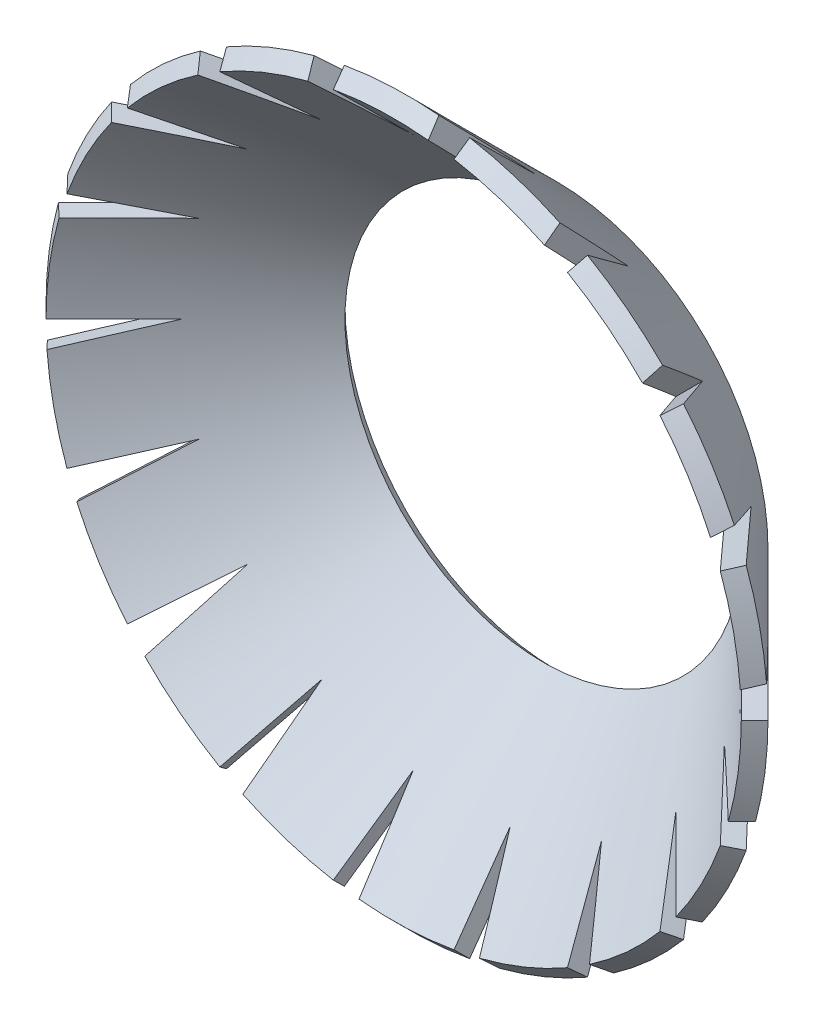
ISO-10303-21;
HEADER;
FILE_DESCRIPTION(('STEP AP214'),'2;1');
FILE_NAME('part.step','',(''),(''),'','','');
FILE_SCHEMA(('AUTOMOTIVE_DESIGN { 1 0 10303 214 1 1 1 1 }'));
ENDSEC;
DATA;
#1=APPLICATION_CONTEXT('core data for automotive mechanical design processes');
#2=APPLICATION_PROTOCOL_DEFINITION('international standard','automotive_design',2000,#1);
#3=PRODUCT_CONTEXT('',#1,'mechanical');
#4=PRODUCT('Part','Part','',(#3));
#5=PRODUCT_RELATED_PRODUCT_CATEGORY('part','',(#4));
#6=PRODUCT_DEFINITION_FORMATION('','',#4);
#7=PRODUCT_DEFINITION_CONTEXT('part definition',#1,'design');
#8=PRODUCT_DEFINITION('design','',#6,#7);
#9=PRODUCT_DEFINITION_SHAPE('','',#8);
#10=(LENGTH_UNIT() NAMED_UNIT(*) SI_UNIT(.MILLI.,.METRE.));
#11=(NAMED_UNIT(*) PLANE_ANGLE_UNIT() SI_UNIT($,.RADIAN.));
#12=(NAMED_UNIT(*) SI_UNIT($,.STERADIAN.) SOLID_ANGLE_UNIT());
#13=UNCERTAINTY_MEASURE_WITH_UNIT(LENGTH_MEASURE(1.E-05),#10,'distance_accuracy_value','');
#14=(GEOMETRIC_REPRESENTATION_CONTEXT(3) GLOBAL_UNCERTAINTY_ASSIGNED_CONTEXT((#13)) GLOBAL_UNIT_ASSIGNED_CONTEXT((#10,
#11,#12)) REPRESENTATION_CONTEXT('',''));
#15=CARTESIAN_POINT('',(0.,0.,0.));
#16=DIRECTION('',(0.,0.,1.));
#17=DIRECTION('',(1.,0.,0.));
#18=AXIS2_PLACEMENT_3D('',#15,#16,#17);
#19=CARTESIAN_POINT('',(0.,0.,0.28284271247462));
#20=DIRECTION('',(0.,0.,-1.));
#21=DIRECTION('',(-1.,0.,0.));
#22=AXIS2_PLACEMENT_3D('',#19,#20,#21);
#23=CONICAL_SURFACE('',#22,7.36715728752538,0.785398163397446);
#24=DIRECTION('',(-0.664463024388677,-0.241844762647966,0.707106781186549));
#25=VECTOR('',#24,1.);
#26=CARTESIAN_POINT('',(0.,0.,7.65000000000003));
#27=LINE('',#26,#25);
#28=CARTESIAN_POINT('',(6.92286333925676,2.51971619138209,0.282842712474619));
#29=VERTEX_POINT('',#28);
#30=CARTESIAN_POINT('',(7.18864854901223,2.61645409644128,0.));
#31=VERTEX_POINT('',#30);
#32=EDGE_CURVE('E382',#29,#31,#27,.F.);
#33=ORIENTED_EDGE('',*,*,#32,.F.);
#34=CARTESIAN_POINT('',(0.,0.,0.28284271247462));
#35=DIRECTION('',(0.,0.,1.));
#36=DIRECTION('',(1.,0.,0.));
#37=AXIS2_PLACEMENT_3D('',#34,#35,#36);
#38=CIRCLE('',#37,7.36715728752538);
#39=CARTESIAN_POINT('',(7.34658595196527,0.550164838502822,0.282842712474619));
#40=VERTEX_POINT('',#39);
#41=EDGE_CURVE('E465',#40,#29,#38,.T.);
#42=ORIENTED_EDGE('',*,*,#41,.F.);
#43=CARTESIAN_POINT('',(7.62195889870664,0.656736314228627,-0.000199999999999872));
#44=CARTESIAN_POINT('',(7.57606755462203,0.638976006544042,0.0470480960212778));
#45=CARTESIAN_POINT('',(7.53015789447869,0.621208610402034,0.0942757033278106));
#46=CARTESIAN_POINT('',(7.43830194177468,0.585659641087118,0.188689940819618));
#47=CARTESIAN_POINT('',(7.39235564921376,0.567878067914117,0.235876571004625));
#48=CARTESIAN_POINT('',(7.34639104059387,0.5500894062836,0.28304271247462));
#49=B_SPLINE_CURVE_WITH_KNOTS('',3,(#43,#44,#45,#46,#47,#48),.UNSPECIFIED.,.F.,.F.,(4,2,4),(0.,
0.204656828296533,0.409313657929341),.UNSPECIFIED.);
#50=CARTESIAN_POINT('',(7.62176463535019,0.656661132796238,0.));
#51=VERTEX_POINT('',#50);
#52=EDGE_CURVE('E402',#51,#40,#49,.T.);
#53=ORIENTED_EDGE('',*,*,#52,.F.);
#54=CARTESIAN_POINT('',(0.,0.,0.));
#55=DIRECTION('',(0.,0.,1.));
#56=DIRECTION('',(1.,0.,0.));
#57=AXIS2_PLACEMENT_3D('',#54,#55,#56);
#58=CIRCLE('',#57,7.65);
#59=EDGE_CURVE('E396',#51,#31,#58,.T.);
#60=ORIENTED_EDGE('',*,*,#59,.T.);
#61=EDGE_LOOP('',(#33,#42,#53,#60));
#62=FACE_BOUND('',#61,.T.);
#63=ADVANCED_FACE('F41',(#62),#23,.T.);
#64=CARTESIAN_POINT('',(6.93768148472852,3.22399374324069,-0.000199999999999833));
#65=CARTESIAN_POINT('',(6.90063211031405,3.19160874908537,0.0470480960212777));
#66=CARTESIAN_POINT('',(6.86356794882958,3.15921082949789,0.0942757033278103));
#67=CARTESIAN_POINT('',(6.78941005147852,3.09438913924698,0.188689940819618));
#68=CARTESIAN_POINT('',(6.75231631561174,3.06196536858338,0.235876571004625));
#69=CARTESIAN_POINT('',(6.71520779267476,3.02952867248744,0.283042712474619));
#70=B_SPLINE_CURVE_WITH_KNOTS('',3,(#64,#65,#66,#67,#68,#69),.UNSPECIFIED.,.F.,.F.,(4,2,4),(0.,
0.204656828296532,0.40931365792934),.UNSPECIFIED.);
#71=CARTESIAN_POINT('',(6.93752465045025,3.22385665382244,0.));
#72=VERTEX_POINT('',#71);
#73=CARTESIAN_POINT('',(6.71536515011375,3.0296662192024,0.282842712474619));
#74=VERTEX_POINT('',#73);
#75=EDGE_CURVE('E1659',#72,#74,#70,.T.);
#76=ORIENTED_EDGE('',*,*,#75,.F.);
#77=CARTESIAN_POINT('',(5.86023998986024,4.91732521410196,0.));
#78=VERTEX_POINT('',#77);
#79=EDGE_CURVE('E401',#72,#78,#58,.T.);
#80=ORIENTED_EDGE('',*,*,#79,.T.);
#81=DIRECTION('',(-0.541675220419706,-0.454519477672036,0.707106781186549));
#82=VECTOR('',#81,1.);
#83=CARTESIAN_POINT('',(0.,0.,7.65000000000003));
#84=LINE('',#83,#82);
#85=CARTESIAN_POINT('',(5.64356990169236,4.73551742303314,0.282842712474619));
#86=VERTEX_POINT('',#85);
#87=EDGE_CURVE('E640',#86,#78,#84,.F.);
#88=ORIENTED_EDGE('',*,*,#87,.F.);
#89=EDGE_CURVE('E1239',#74,#86,#38,.T.);
#90=ORIENTED_EDGE('',*,*,#89,.F.);
#91=EDGE_LOOP('',(#76,#80,#88,#90));
#92=FACE_BOUND('',#91,.T.);
#93=ADVANCED_FACE('F1060',(#92),#23,.T.);
#94=CARTESIAN_POINT('',(5.41661729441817,5.4023899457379,-0.000200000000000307));
#95=CARTESIAN_POINT('',(5.39287859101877,5.3592863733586,0.0470480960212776));
#96=CARTESIAN_POINT('',(5.36913041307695,5.31616559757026,0.0942757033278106));
#97=CARTESIAN_POINT('',(5.32161510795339,5.22988963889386,0.188689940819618));
#98=CARTESIAN_POINT('',(5.29784798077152,5.18673445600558,0.235876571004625));
#99=CARTESIAN_POINT('',(5.27407137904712,5.14356206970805,0.283042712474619));
#100=B_SPLINE_CURVE_WITH_KNOTS('',3,(#94,#95,#96,#97,#98,#99),.UNSPECIFIED.,.F.,.F.,(4,2,4),(0.,
0.204656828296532,0.409313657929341),.UNSPECIFIED.);
#101=CARTESIAN_POINT('',(5.41651680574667,5.40220748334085,0.));
#102=VERTEX_POINT('',#101);
#103=CARTESIAN_POINT('',(5.2741722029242,5.14374514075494,0.282842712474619));
#104=VERTEX_POINT('',#103);
#105=EDGE_CURVE('E624',#102,#104,#100,.T.);
#106=ORIENTED_EDGE('',*,*,#105,.F.);
#107=CARTESIAN_POINT('',(3.82500000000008,6.62509433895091,0.));
#108=VERTEX_POINT('',#107);
#109=EDGE_CURVE('E408',#102,#108,#58,.T.);
#110=ORIENTED_EDGE('',*,*,#109,.T.);
#111=DIRECTION('',(-0.35355339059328,-0.612372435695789,0.707106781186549));
#112=VECTOR('',#111,1.);
#113=CARTESIAN_POINT('',(0.,0.,7.65000000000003));
#114=LINE('',#113,#112);
#115=CARTESIAN_POINT('',(3.68357864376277,6.3801453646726,0.282842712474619));
#116=VERTEX_POINT('',#115);
#117=EDGE_CURVE('E1172',#116,#108,#114,.F.);
#118=ORIENTED_EDGE('',*,*,#117,.F.);
#119=EDGE_CURVE('E1243',#104,#116,#38,.T.);
#120=ORIENTED_EDGE('',*,*,#119,.F.);
#121=EDGE_LOOP('',(#106,#110,#118,#120));
#122=FACE_BOUND('',#121,.T.);
#123=ADVANCED_FACE('F1063',(#122),#23,.T.);
#124=CARTESIAN_POINT('',(3.24222911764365,6.92917818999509,-0.000200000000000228));
#125=CARTESIAN_POINT('',(3.23466432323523,6.88055496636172,0.0470480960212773));
#126=CARTESIAN_POINT('',(3.22709650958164,6.83191233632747,0.0942757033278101));
#127=CARTESIAN_POINT('',(3.2119548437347,6.73458826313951,0.188689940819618));
#128=CARTESIAN_POINT('',(3.20438099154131,6.68590681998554,0.235876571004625));
#129=CARTESIAN_POINT('',(3.19680412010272,6.63720597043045,0.283042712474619));
#130=B_SPLINE_CURVE_WITH_KNOTS('',3,(#124,#125,#126,#127,#128,#129),.UNSPECIFIED.,.F.,.F.,(4,2,
4),(0.,0.204656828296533,0.409313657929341),.UNSPECIFIED.);
#131=CARTESIAN_POINT('',(3.24219709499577,6.92897236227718,0.));
#132=VERTEX_POINT('',#131);
#133=CARTESIAN_POINT('',(3.19683624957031,6.63741248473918,0.282842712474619));
#134=VERTEX_POINT('',#133);
#135=EDGE_CURVE('E646',#132,#134,#130,.T.);
#136=ORIENTED_EDGE('',*,*,#135,.F.);
#137=CARTESIAN_POINT('',(1.32840855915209,7.53377931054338,0.));
#138=VERTEX_POINT('',#137);
#139=EDGE_CURVE('E1180',#132,#138,#58,.T.);
#140=ORIENTED_EDGE('',*,*,#139,.T.);
#141=DIRECTION('',(-0.12278780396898,-0.696364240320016,0.707106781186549));
#142=VECTOR('',#141,1.);
#143=CARTESIAN_POINT('',(0.,0.,7.65000000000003));
#144=LINE('',#143,#142);
#145=CARTESIAN_POINT('',(1.2792934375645,7.25523361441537,0.282842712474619));
#146=VERTEX_POINT('',#145);
#147=EDGE_CURVE('E695',#146,#138,#144,.F.);
#148=ORIENTED_EDGE('',*,*,#147,.F.);
#149=EDGE_CURVE('E1679',#134,#146,#38,.T.);
#150=ORIENTED_EDGE('',*,*,#149,.F.);
#151=EDGE_LOOP('',(#136,#140,#148,#150));
#152=FACE_BOUND('',#151,.T.);
#153=ADVANCED_FACE('F1362',(#152),#23,.T.);
#154=CARTESIAN_POINT('',(0.676780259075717,7.62020528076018,-0.000199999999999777));
#155=CARTESIAN_POINT('',(0.6863017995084,7.57192708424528,0.0470480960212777));
#156=CARTESIAN_POINT('',(0.695827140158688,7.52362961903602,0.0942757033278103));
#157=CARTESIAN_POINT('',(0.714885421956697,7.4269961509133,0.188689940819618));
#158=CARTESIAN_POINT('',(0.724418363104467,7.3786601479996,0.235876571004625));
#159=CARTESIAN_POINT('',(0.733955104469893,7.33030487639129,0.283042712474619));
#160=B_SPLINE_CURVE_WITH_KNOTS('',3,(#154,#155,#156,#157,#158,#159),.UNSPECIFIED.,.F.,.F.,(4,2,
4),(0.,0.204656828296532,0.40931365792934),.UNSPECIFIED.);
#161=CARTESIAN_POINT('',(0.67682056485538,7.62000091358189,0.));
#162=VERTEX_POINT('',#161);
#163=CARTESIAN_POINT('',(0.733914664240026,7.3305099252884,0.282842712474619));
#164=VERTEX_POINT('',#163);
#165=EDGE_CURVE('E676',#162,#164,#160,.T.);
#166=ORIENTED_EDGE('',*,*,#165,.F.);
#167=CARTESIAN_POINT('',(-1.32840855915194,7.53377931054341,0.));
#168=VERTEX_POINT('',#167);
#169=EDGE_CURVE('E1177',#162,#168,#58,.T.);
#170=ORIENTED_EDGE('',*,*,#169,.T.);
#171=DIRECTION('',(0.122787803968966,-0.696364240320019,0.707106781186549));
#172=VECTOR('',#171,1.);
#173=CARTESIAN_POINT('',(0.,0.,7.65000000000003));
#174=LINE('',#173,#172);
#175=CARTESIAN_POINT('',(-1.27929343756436,7.2552336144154,0.282842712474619));
#176=VERTEX_POINT('',#175);
#177=EDGE_CURVE('E1750',#176,#168,#174,.F.);
#178=ORIENTED_EDGE('',*,*,#177,.F.);
#179=EDGE_CURVE('E1682',#164,#176,#38,.T.);
#180=ORIENTED_EDGE('',*,*,#179,.F.);
#181=EDGE_LOOP('',(#166,#170,#178,#180));
#182=FACE_BOUND('',#181,.T.);
#183=ADVANCED_FACE('F1354',(#182),#23,.T.);
#184=CARTESIAN_POINT('',(-1.97029828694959,7.39212315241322,-0.000199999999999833));
#185=CARTESIAN_POINT('',(-1.94483884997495,7.35001304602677,0.0470480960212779));
#186=CARTESIAN_POINT('',(-1.91936925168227,7.3078861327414,0.0942757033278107));
#187=CARTESIAN_POINT('',(-1.86840973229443,7.22359869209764,0.188689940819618));
#188=CARTESIAN_POINT('',(-1.84291981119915,7.18143816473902,0.235876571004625));
#189=CARTESIAN_POINT('',(-1.81741972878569,7.13926083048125,0.283042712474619));
#190=B_SPLINE_CURVE_WITH_KNOTS('',3,(#184,#185,#186,#187,#188,#189),.UNSPECIFIED.,.F.,.F.,(4,2,
4),(0.,0.204656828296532,0.40931365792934),.UNSPECIFIED.);
#191=CARTESIAN_POINT('',(-1.97019051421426,7.39194489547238,0.));
#192=VERTEX_POINT('',#191);
#193=CARTESIAN_POINT('',(-1.81752786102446,7.13943968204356,0.282842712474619));
#194=VERTEX_POINT('',#193);
#195=EDGE_CURVE('E701',#192,#194,#190,.T.);
#196=ORIENTED_EDGE('',*,*,#195,.F.);
#197=CARTESIAN_POINT('',(-3.82499999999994,6.62509433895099,0.));
#198=VERTEX_POINT('',#197);
#199=EDGE_CURVE('E1182',#192,#198,#58,.T.);
#200=ORIENTED_EDGE('',*,*,#199,.T.);
#201=DIRECTION('',(0.353553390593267,-0.612372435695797,0.707106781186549));
#202=VECTOR('',#201,1.);
#203=CARTESIAN_POINT('',(0.,0.,7.65000000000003));
#204=LINE('',#203,#202);
#205=CARTESIAN_POINT('',(-3.68357864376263,6.38014536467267,0.282842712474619));
#206=VERTEX_POINT('',#205);
#207=EDGE_CURVE('E747',#206,#198,#204,.F.);
#208=ORIENTED_EDGE('',*,*,#207,.F.);
#209=EDGE_CURVE('E1683',#194,#206,#38,.T.);
#210=ORIENTED_EDGE('',*,*,#209,.F.);
#211=EDGE_LOOP('',(#196,#200,#208,#210));
#212=FACE_BOUND('',#211,.T.);
#213=ADVANCED_FACE('F1348',(#212),#23,.T.);
#214=CARTESIAN_POINT('',(-4.37972978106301,6.27244187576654,-0.000200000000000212));
#215=CARTESIAN_POINT('',(-4.34140323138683,6.24157895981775,0.0470480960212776));
#216=CARTESIAN_POINT('',(-4.30306138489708,6.21070372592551,0.0942757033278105));
#217=CARTESIAN_POINT('',(-4.22634709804,6.14892862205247,0.188689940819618));
#218=CARTESIAN_POINT('',(-4.18797465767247,6.1180287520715,0.235876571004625));
#219=CARTESIAN_POINT('',(-4.14958692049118,6.08711656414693,0.283042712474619));
#220=B_SPLINE_CURVE_WITH_KNOTS('',3,(#214,#215,#216,#217,#218,#219),.UNSPECIFIED.,.F.,.F.,(4,2,
4),(0.,0.204656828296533,0.409313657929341),.UNSPECIFIED.);
#221=CARTESIAN_POINT('',(-4.37956754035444,6.27231122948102,0.));
#222=VERTEX_POINT('',#221);
#223=CARTESIAN_POINT('',(-4.14974970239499,6.08724764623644,0.282842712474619));
#224=VERTEX_POINT('',#223);
#225=EDGE_CURVE('E732',#222,#224,#220,.T.);
#226=ORIENTED_EDGE('',*,*,#225,.F.);
#227=CARTESIAN_POINT('',(-5.86023998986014,4.91732521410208,0.));
#228=VERTEX_POINT('',#227);
#229=EDGE_CURVE('E1183',#222,#228,#58,.T.);
#230=ORIENTED_EDGE('',*,*,#229,.T.);
#231=DIRECTION('',(0.541675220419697,-0.454519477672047,0.707106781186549));
#232=VECTOR('',#231,1.);
#233=CARTESIAN_POINT('',(0.,0.,7.65000000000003));
#234=LINE('',#233,#232);
#235=CARTESIAN_POINT('',(-5.64356990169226,4.73551742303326,0.282842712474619));
#236=VERTEX_POINT('',#235);
#237=EDGE_CURVE('E1744',#236,#228,#234,.F.);
#238=ORIENTED_EDGE('',*,*,#237,.F.);
#239=EDGE_CURVE('E1689',#224,#236,#38,.T.);
#240=ORIENTED_EDGE('',*,*,#239,.F.);
#241=EDGE_LOOP('',(#226,#230,#238,#240));
#242=FACE_BOUND('',#241,.T.);
#243=ADVANCED_FACE('F1337',(#242),#23,.T.);
#244=CARTESIAN_POINT('',(-6.2609012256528,4.39621153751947,-0.000200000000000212));
#245=CARTESIAN_POINT('',(-6.21433031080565,4.38031833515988,0.0470480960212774));
#246=CARTESIAN_POINT('',(-6.16774080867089,4.3644187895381,0.0942757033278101));
#247=CARTESIAN_POINT('',(-6.07452462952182,4.3326070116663,0.188689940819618));
#248=CARTESIAN_POINT('',(-6.02789795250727,4.3166947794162,0.235876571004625));
#249=CARTESIAN_POINT('',(-5.98125268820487,4.30077620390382,0.283042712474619));
#250=B_SPLINE_CURVE_WITH_KNOTS('',3,(#244,#245,#246,#247,#248,#249),.UNSPECIFIED.,.F.,.F.,(4,2,
4),(0.,0.204656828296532,0.40931365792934),.UNSPECIFIED.);
#251=CARTESIAN_POINT('',(-6.26070408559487,4.39614425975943,0.));
#252=VERTEX_POINT('',#251);
#253=CARTESIAN_POINT('',(-5.98145048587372,4.30084370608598,0.282842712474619));
#254=VERTEX_POINT('',#253);
#255=EDGE_CURVE('E756',#252,#254,#250,.T.);
#256=ORIENTED_EDGE('',*,*,#255,.F.);
#257=CARTESIAN_POINT('',(-7.18864854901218,2.61645409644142,0.));
#258=VERTEX_POINT('',#257);
#259=EDGE_CURVE('E1188',#252,#258,#58,.T.);
#260=ORIENTED_EDGE('',*,*,#259,.T.);
#261=DIRECTION('',(0.664463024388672,-0.24184476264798,0.707106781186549));
#262=VECTOR('',#261,1.);
#263=CARTESIAN_POINT('',(0.,0.,7.65000000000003));
#264=LINE('',#263,#262);
#265=CARTESIAN_POINT('',(-6.92286333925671,2.51971619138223,0.282842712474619));
#266=VERTEX_POINT('',#265);
#267=EDGE_CURVE('E805',#266,#258,#264,.F.);
#268=ORIENTED_EDGE('',*,*,#267,.F.);
#269=EDGE_CURVE('E1692',#254,#266,#38,.T.);
#270=ORIENTED_EDGE('',*,*,#269,.F.);
#271=EDGE_LOOP('',(#256,#260,#268,#270));
#272=FACE_BOUND('',#271,.T.);
#273=ADVANCED_FACE('F1331',(#272),#23,.T.);
#274=CARTESIAN_POINT('',(-7.38691558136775,1.98973320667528,-0.000200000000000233));
#275=CARTESIAN_POINT('',(-7.33771744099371,1.99072667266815,0.0470480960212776));
#276=CARTESIAN_POINT('',(-7.28849966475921,1.99172053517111,0.0942757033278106));
#277=CARTESIAN_POINT('',(-7.19002484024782,1.99370905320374,0.188689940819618));
#278=CARTESIAN_POINT('',(-7.14076779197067,1.99470370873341,0.235876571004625));
#279=CARTESIAN_POINT('',(-7.0914911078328,1.99569876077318,0.28304271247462));
#280=B_SPLINE_CURVE_WITH_KNOTS('',3,(#274,#275,#276,#277,#278,#279),.UNSPECIFIED.,.F.,.F.,(4,2,
4),(0.,0.204656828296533,0.409313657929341),.UNSPECIFIED.);
#281=CARTESIAN_POINT('',(-7.38670731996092,1.9897374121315,0.));
#282=VERTEX_POINT('',#281);
#283=CARTESIAN_POINT('',(-7.09170006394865,1.99569454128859,0.282842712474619));
#284=VERTEX_POINT('',#283);
#285=EDGE_CURVE('E786',#282,#284,#280,.T.);
#286=ORIENTED_EDGE('',*,*,#285,.F.);
#287=CARTESIAN_POINT('',(-7.65,0.,0.));
#288=VERTEX_POINT('',#287);
#289=EDGE_CURVE('E1191',#282,#288,#58,.T.);
#290=ORIENTED_EDGE('',*,*,#289,.T.);
#291=DIRECTION('',(0.707106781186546,0.,0.707106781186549));
#292=VECTOR('',#291,1.);
#293=CARTESIAN_POINT('',(0.,0.,7.65000000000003));
#294=LINE('',#293,#292);
#295=CARTESIAN_POINT('',(-7.36715728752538,0.,0.282842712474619));
#296=VERTEX_POINT('',#295);
#297=EDGE_CURVE('E1742',#296,#288,#294,.F.);
#298=ORIENTED_EDGE('',*,*,#297,.F.);
#299=EDGE_CURVE('E1699',#284,#296,#38,.T.);
#300=ORIENTED_EDGE('',*,*,#299,.F.);
#301=EDGE_LOOP('',(#286,#290,#298,#300));
#302=FACE_BOUND('',#301,.T.);
#303=ADVANCED_FACE('F1324',(#302),#23,.T.);
#304=CARTESIAN_POINT('',(-7.62195889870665,-0.656736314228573,-0.000199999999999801));
#305=CARTESIAN_POINT('',(-7.57606755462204,-0.638976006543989,0.0470480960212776));
#306=CARTESIAN_POINT('',(-7.5301578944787,-0.621208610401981,0.0942757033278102));
#307=CARTESIAN_POINT('',(-7.43830194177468,-0.585659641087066,0.188689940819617));
#308=CARTESIAN_POINT('',(-7.39235564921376,-0.567878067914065,0.235876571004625));
#309=CARTESIAN_POINT('',(-7.34639104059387,-0.55008940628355,0.283042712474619));
#310=B_SPLINE_CURVE_WITH_KNOTS('',3,(#304,#305,#306,#307,#308,#309),.UNSPECIFIED.,.F.,.F.,(4,2,
4),(0.,0.204656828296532,0.40931365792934),.UNSPECIFIED.);
#311=CARTESIAN_POINT('',(-7.62176463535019,-0.656661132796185,0.));
#312=VERTEX_POINT('',#311);
#313=CARTESIAN_POINT('',(-7.34658595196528,-0.550164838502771,0.282842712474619));
#314=VERTEX_POINT('',#313);
#315=EDGE_CURVE('E813',#312,#314,#310,.T.);
#316=ORIENTED_EDGE('',*,*,#315,.F.);
#317=CARTESIAN_POINT('',(-7.18864854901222,-2.61645409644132,0.));
#318=VERTEX_POINT('',#317);
#319=EDGE_CURVE('E1200',#312,#318,#58,.T.);
#320=ORIENTED_EDGE('',*,*,#319,.T.);
#321=DIRECTION('',(0.664463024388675,0.241844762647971,0.707106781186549));
#322=VECTOR('',#321,1.);
#323=CARTESIAN_POINT('',(0.,0.,7.65000000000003));
#324=LINE('',#323,#322);
#325=CARTESIAN_POINT('',(-6.92286333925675,-2.51971619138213,0.282842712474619));
#326=VERTEX_POINT('',#325);
#327=EDGE_CURVE('E860',#326,#318,#324,.F.);
#328=ORIENTED_EDGE('',*,*,#327,.F.);
#329=EDGE_CURVE('E1701',#314,#326,#38,.T.);
#330=ORIENTED_EDGE('',*,*,#329,.F.);
#331=EDGE_LOOP('',(#316,#320,#328,#330));
#332=FACE_BOUND('',#331,.T.);
#333=ADVANCED_FACE('F1317',(#332),#23,.T.);
#334=CARTESIAN_POINT('',(-6.9376814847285,-3.22399374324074,-0.000200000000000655));
#335=CARTESIAN_POINT('',(-6.90063211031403,-3.19160874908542,0.047048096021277));
#336=CARTESIAN_POINT('',(-6.86356794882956,-3.15921082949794,0.0942757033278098));
#337=CARTESIAN_POINT('',(-6.7894100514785,-3.09438913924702,0.188689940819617));
#338=CARTESIAN_POINT('',(-6.75231631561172,-3.06196536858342,0.235876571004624));
#339=CARTESIAN_POINT('',(-6.71520779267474,-3.02952867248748,0.283042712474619));
#340=B_SPLINE_CURVE_WITH_KNOTS('',3,(#334,#335,#336,#337,#338,#339),.UNSPECIFIED.,.F.,.F.,(4,2,
4),(0.,0.204656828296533,0.40931365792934),.UNSPECIFIED.);
#341=CARTESIAN_POINT('',(-6.93752465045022,-3.22385665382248,0.));
#342=VERTEX_POINT('',#341);
#343=CARTESIAN_POINT('',(-6.71536515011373,-3.02966621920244,0.282842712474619));
#344=VERTEX_POINT('',#343);
#345=EDGE_CURVE('E842',#342,#344,#340,.T.);
#346=ORIENTED_EDGE('',*,*,#345,.F.);
#347=CARTESIAN_POINT('',(-5.86023998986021,-4.917325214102,0.));
#348=VERTEX_POINT('',#347);
#349=EDGE_CURVE('E1203',#342,#348,#58,.T.);
#350=ORIENTED_EDGE('',*,*,#349,.T.);
#351=DIRECTION('',(0.541675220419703,0.45451947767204,0.707106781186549));
#352=VECTOR('',#351,1.);
#353=CARTESIAN_POINT('',(0.,0.,7.65000000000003));
#354=LINE('',#353,#352);
#355=CARTESIAN_POINT('',(-5.64356990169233,-4.73551742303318,0.282842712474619));
#356=VERTEX_POINT('',#355);
#357=EDGE_CURVE('E1741',#356,#348,#354,.F.);
#358=ORIENTED_EDGE('',*,*,#357,.F.);
#359=EDGE_CURVE('E1707',#344,#356,#38,.T.);
#360=ORIENTED_EDGE('',*,*,#359,.F.);
#361=EDGE_LOOP('',(#346,#350,#358,#360));
#362=FACE_BOUND('',#361,.T.);
#363=ADVANCED_FACE('F1307',(#362),#23,.T.);
#364=CARTESIAN_POINT('',(-5.41661729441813,-5.40238994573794,-0.000200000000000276));
#365=CARTESIAN_POINT('',(-5.39287859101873,-5.35928637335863,0.0470480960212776));
#366=CARTESIAN_POINT('',(-5.36913041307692,-5.3161655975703,0.0942757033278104));
#367=CARTESIAN_POINT('',(-5.32161510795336,-5.2298896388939,0.188689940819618));
#368=CARTESIAN_POINT('',(-5.29784798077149,-5.18673445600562,0.235876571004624));
#369=CARTESIAN_POINT('',(-5.27407137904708,-5.14356206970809,0.283042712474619));
#370=B_SPLINE_CURVE_WITH_KNOTS('',3,(#364,#365,#366,#367,#368,#369),.UNSPECIFIED.,.F.,.F.,(4,2,
4),(0.,0.204656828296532,0.40931365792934),.UNSPECIFIED.);
#371=CARTESIAN_POINT('',(-5.41651680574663,-5.40220748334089,0.));
#372=VERTEX_POINT('',#371);
#373=CARTESIAN_POINT('',(-5.27417220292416,-5.14374514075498,0.282842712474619));
#374=VERTEX_POINT('',#373);
#375=EDGE_CURVE('E868',#372,#374,#370,.T.);
#376=ORIENTED_EDGE('',*,*,#375,.F.);
#377=CARTESIAN_POINT('',(-3.82500000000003,-6.62509433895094,0.));
#378=VERTEX_POINT('',#377);
#379=EDGE_CURVE('E1204',#372,#378,#58,.T.);
#380=ORIENTED_EDGE('',*,*,#379,.T.);
#381=DIRECTION('',(0.353553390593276,0.612372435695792,0.707106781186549));
#382=VECTOR('',#381,1.);
#383=CARTESIAN_POINT('',(0.,0.,7.65000000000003));
#384=LINE('',#383,#382);
#385=CARTESIAN_POINT('',(-3.68357864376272,-6.38014536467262,0.282842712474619));
#386=VERTEX_POINT('',#385);
#387=EDGE_CURVE('E915',#386,#378,#384,.F.);
#388=ORIENTED_EDGE('',*,*,#387,.F.);
#389=EDGE_CURVE('E1715',#374,#386,#38,.T.);
#390=ORIENTED_EDGE('',*,*,#389,.F.);
#391=EDGE_LOOP('',(#376,#380,#388,#390));
#392=FACE_BOUND('',#391,.T.);
#393=ADVANCED_FACE('F1301',(#392),#23,.T.);
#394=CARTESIAN_POINT('',(-3.2422291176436,-6.92917818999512,-0.00020000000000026));
#395=CARTESIAN_POINT('',(-3.23466432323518,-6.88055496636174,0.0470480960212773));
#396=CARTESIAN_POINT('',(-3.22709650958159,-6.83191233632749,0.0942757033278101));
#397=CARTESIAN_POINT('',(-3.21195484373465,-6.73458826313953,0.188689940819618));
#398=CARTESIAN_POINT('',(-3.20438099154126,-6.68590681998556,0.235876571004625));
#399=CARTESIAN_POINT('',(-3.19680412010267,-6.63720597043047,0.28304271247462));
#400=B_SPLINE_CURVE_WITH_KNOTS('',3,(#394,#395,#396,#397,#398,#399),.UNSPECIFIED.,.F.,.F.,(4,2,
4),(0.,0.204656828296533,0.409313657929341),.UNSPECIFIED.);
#401=CARTESIAN_POINT('',(-3.24219709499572,-6.9289723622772,0.));
#402=VERTEX_POINT('',#401);
#403=CARTESIAN_POINT('',(-3.19683624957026,-6.63741248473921,0.282842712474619));
#404=VERTEX_POINT('',#403);
#405=EDGE_CURVE('E897',#402,#404,#400,.T.);
#406=ORIENTED_EDGE('',*,*,#405,.F.);
#407=CARTESIAN_POINT('',(-1.32840855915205,-7.53377931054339,0.));
#408=VERTEX_POINT('',#407);
#409=EDGE_CURVE('E1209',#402,#408,#58,.T.);
#410=ORIENTED_EDGE('',*,*,#409,.T.);
#411=DIRECTION('',(0.122787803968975,0.696364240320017,0.707106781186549));
#412=VECTOR('',#411,1.);
#413=CARTESIAN_POINT('',(0.,0.,7.65000000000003));
#414=LINE('',#413,#412);
#415=CARTESIAN_POINT('',(-1.27929343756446,-7.25523361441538,0.282842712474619));
#416=VERTEX_POINT('',#415);
#417=EDGE_CURVE('E1737',#416,#408,#414,.F.);
#418=ORIENTED_EDGE('',*,*,#417,.F.);
#419=EDGE_CURVE('E1720',#404,#416,#38,.T.);
#420=ORIENTED_EDGE('',*,*,#419,.F.);
#421=EDGE_LOOP('',(#406,#410,#418,#420));
#422=FACE_BOUND('',#421,.T.);
#423=ADVANCED_FACE('F1293',(#422),#23,.T.);
#424=CARTESIAN_POINT('',(-0.676780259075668,-7.62020528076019,-0.000200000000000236));
#425=CARTESIAN_POINT('',(-0.68630179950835,-7.57192708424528,0.0470480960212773));
#426=CARTESIAN_POINT('',(-0.695827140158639,-7.52362961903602,0.09427570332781));
#427=CARTESIAN_POINT('',(-0.714885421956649,-7.42699615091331,0.188689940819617));
#428=CARTESIAN_POINT('',(-0.724418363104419,-7.3786601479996,0.235876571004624));
#429=CARTESIAN_POINT('',(-0.733955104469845,-7.33030487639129,0.283042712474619));
#430=B_SPLINE_CURVE_WITH_KNOTS('',3,(#424,#425,#426,#427,#428,#429),.UNSPECIFIED.,.F.,.F.,(4,2,
4),(0.,0.204656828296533,0.409313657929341),.UNSPECIFIED.);
#431=CARTESIAN_POINT('',(-0.67682056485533,-7.6200009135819,0.));
#432=VERTEX_POINT('',#431);
#433=CARTESIAN_POINT('',(-0.73391466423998,-7.33050992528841,0.282842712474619));
#434=VERTEX_POINT('',#433);
#435=EDGE_CURVE('E922',#432,#434,#430,.T.);
#436=ORIENTED_EDGE('',*,*,#435,.F.);
#437=CARTESIAN_POINT('',(1.32840855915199,-7.5337793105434,0.));
#438=VERTEX_POINT('',#437);
#439=EDGE_CURVE('E1213',#432,#438,#58,.T.);
#440=ORIENTED_EDGE('',*,*,#439,.T.);
#441=DIRECTION('',(-0.12278780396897,0.696364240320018,0.707106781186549));
#442=VECTOR('',#441,1.);
#443=CARTESIAN_POINT('',(0.,0.,7.65000000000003));
#444=LINE('',#443,#442);
#445=CARTESIAN_POINT('',(1.27929343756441,-7.25523361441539,0.282842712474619));
#446=VERTEX_POINT('',#445);
#447=EDGE_CURVE('E970',#446,#438,#444,.F.);
#448=ORIENTED_EDGE('',*,*,#447,.F.);
#449=EDGE_CURVE('E1723',#434,#446,#38,.T.);
#450=ORIENTED_EDGE('',*,*,#449,.F.);
#451=EDGE_LOOP('',(#436,#440,#448,#450));
#452=FACE_BOUND('',#451,.T.);
#453=ADVANCED_FACE('F1287',(#452),#23,.T.);
#454=CARTESIAN_POINT('',(1.97029828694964,-7.3921231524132,-0.000200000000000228));
#455=CARTESIAN_POINT('',(1.944838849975,-7.35001304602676,0.0470480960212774));
#456=CARTESIAN_POINT('',(1.91936925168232,-7.30788613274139,0.0942757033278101));
#457=CARTESIAN_POINT('',(1.86840973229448,-7.22359869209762,0.188689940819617));
#458=CARTESIAN_POINT('',(1.8429198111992,-7.181438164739,0.235876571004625));
#459=CARTESIAN_POINT('',(1.81741972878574,-7.13926083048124,0.283042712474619));
#460=B_SPLINE_CURVE_WITH_KNOTS('',3,(#454,#455,#456,#457,#458,#459),.UNSPECIFIED.,.F.,.F.,(4,2,
4),(0.,0.204656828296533,0.409313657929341),.UNSPECIFIED.);
#461=CARTESIAN_POINT('',(1.97019051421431,-7.39194489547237,0.));
#462=VERTEX_POINT('',#461);
#463=CARTESIAN_POINT('',(1.81752786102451,-7.13943968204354,0.282842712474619));
#464=VERTEX_POINT('',#463);
#465=EDGE_CURVE('E953',#462,#464,#460,.T.);
#466=ORIENTED_EDGE('',*,*,#465,.F.);
#467=CARTESIAN_POINT('',(3.82499999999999,-6.62509433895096,0.));
#468=VERTEX_POINT('',#467);
#469=EDGE_CURVE('E1220',#462,#468,#58,.T.);
#470=ORIENTED_EDGE('',*,*,#469,.T.);
#471=DIRECTION('',(-0.353553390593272,0.612372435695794,0.707106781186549));
#472=VECTOR('',#471,1.);
#473=CARTESIAN_POINT('',(0.,0.,7.65000000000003));
#474=LINE('',#473,#472);
#475=CARTESIAN_POINT('',(3.68357864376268,-6.38014536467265,0.282842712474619));
#476=VERTEX_POINT('',#475);
#477=EDGE_CURVE('E1740',#476,#468,#474,.F.);
#478=ORIENTED_EDGE('',*,*,#477,.F.);
#479=EDGE_CURVE('E1728',#464,#476,#38,.T.);
#480=ORIENTED_EDGE('',*,*,#479,.F.);
#481=EDGE_LOOP('',(#466,#470,#478,#480));
#482=FACE_BOUND('',#481,.T.);
#483=ADVANCED_FACE('F1279',(#482),#23,.T.);
#484=CARTESIAN_POINT('',(4.37972978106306,-6.27244187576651,-0.000200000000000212));
#485=CARTESIAN_POINT('',(4.34140323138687,-6.24157895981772,0.0470480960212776));
#486=CARTESIAN_POINT('',(4.30306138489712,-6.21070372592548,0.0942757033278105));
#487=CARTESIAN_POINT('',(4.22634709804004,-6.14892862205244,0.188689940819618));
#488=CARTESIAN_POINT('',(4.18797465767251,-6.11802875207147,0.235876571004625));
#489=CARTESIAN_POINT('',(4.14958692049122,-6.0871165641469,0.28304271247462));
#490=B_SPLINE_CURVE_WITH_KNOTS('',3,(#484,#485,#486,#487,#488,#489),.UNSPECIFIED.,.F.,.F.,(4,2,
4),(0.,0.204656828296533,0.409313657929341),.UNSPECIFIED.);
#491=CARTESIAN_POINT('',(4.37956754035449,-6.27231122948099,0.));
#492=VERTEX_POINT('',#491);
#493=CARTESIAN_POINT('',(4.14974970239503,-6.08724764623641,0.282842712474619));
#494=VERTEX_POINT('',#493);
#495=EDGE_CURVE('E978',#492,#494,#490,.T.);
#496=ORIENTED_EDGE('',*,*,#495,.F.);
#497=CARTESIAN_POINT('',(5.86023998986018,-4.91732521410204,0.));
#498=VERTEX_POINT('',#497);
#499=EDGE_CURVE('E416',#492,#498,#58,.T.);
#500=ORIENTED_EDGE('',*,*,#499,.T.);
#501=DIRECTION('',(-0.5416752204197,0.454519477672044,0.707106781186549));
#502=VECTOR('',#501,1.);
#503=CARTESIAN_POINT('',(0.,0.,7.65000000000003));
#504=LINE('',#503,#502);
#505=CARTESIAN_POINT('',(5.6435699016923,-4.73551742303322,0.282842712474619));
#506=VERTEX_POINT('',#505);
#507=EDGE_CURVE('E1025',#506,#498,#504,.F.);
#508=ORIENTED_EDGE('',*,*,#507,.F.);
#509=EDGE_CURVE('E1241',#494,#506,#38,.T.);
#510=ORIENTED_EDGE('',*,*,#509,.F.);
#511=EDGE_LOOP('',(#496,#500,#508,#510));
#512=FACE_BOUND('',#511,.T.);
#513=ADVANCED_FACE('F1067',(#512),#23,.T.);
#514=CARTESIAN_POINT('',(6.26090122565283,-4.39621153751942,-0.00019999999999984));
#515=CARTESIAN_POINT('',(6.21433031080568,-4.38031833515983,0.0470480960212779));
#516=CARTESIAN_POINT('',(6.16774080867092,-4.36441878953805,0.0942757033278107));
#517=CARTESIAN_POINT('',(6.07452462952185,-4.33260701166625,0.188689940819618));
#518=CARTESIAN_POINT('',(6.0278979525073,-4.31669477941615,0.235876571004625));
#519=CARTESIAN_POINT('',(5.9812526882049,-4.30077620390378,0.28304271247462));
#520=B_SPLINE_CURVE_WITH_KNOTS('',3,(#514,#515,#516,#517,#518,#519),.UNSPECIFIED.,.F.,.F.,(4,2,
4),(0.,0.204656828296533,0.409313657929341),.UNSPECIFIED.);
#521=CARTESIAN_POINT('',(6.2607040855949,-4.39614425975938,0.));
#522=VERTEX_POINT('',#521);
#523=CARTESIAN_POINT('',(5.98145048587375,-4.30084370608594,0.282842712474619));
#524=VERTEX_POINT('',#523);
#525=EDGE_CURVE('E1006',#522,#524,#520,.T.);
#526=ORIENTED_EDGE('',*,*,#525,.F.);
#527=CARTESIAN_POINT('',(7.1886485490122,-2.61645409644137,0.));
#528=VERTEX_POINT('',#527);
#529=EDGE_CURVE('E413',#522,#528,#58,.T.);
#530=ORIENTED_EDGE('',*,*,#529,.T.);
#531=DIRECTION('',(-0.664463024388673,0.241844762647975,0.707106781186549));
#532=VECTOR('',#531,1.);
#533=CARTESIAN_POINT('',(0.,0.,7.65000000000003));
#534=LINE('',#533,#532);
#535=CARTESIAN_POINT('',(6.92286333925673,-2.51971619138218,0.282842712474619));
#536=VERTEX_POINT('',#535);
#537=EDGE_CURVE('E1235',#536,#528,#534,.F.);
#538=ORIENTED_EDGE('',*,*,#537,.F.);
#539=EDGE_CURVE('E1245',#524,#536,#38,.T.);
#540=ORIENTED_EDGE('',*,*,#539,.F.);
#541=EDGE_LOOP('',(#526,#530,#538,#540));
#542=FACE_BOUND('',#541,.T.);
#543=ADVANCED_FACE('F1062',(#542),#23,.T.);
#544=CARTESIAN_POINT('',(7.38691558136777,-1.98973320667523,-0.000199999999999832));
#545=CARTESIAN_POINT('',(7.33771744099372,-1.9907266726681,0.0470480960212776));
#546=CARTESIAN_POINT('',(7.28849966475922,-1.99172053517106,0.0942757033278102));
#547=CARTESIAN_POINT('',(7.19002484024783,-1.99370905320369,0.188689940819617));
#548=CARTESIAN_POINT('',(7.14076779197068,-1.99470370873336,0.235876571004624));
#549=CARTESIAN_POINT('',(7.09149110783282,-1.99569876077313,0.283042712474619));
#550=B_SPLINE_CURVE_WITH_KNOTS('',3,(#544,#545,#546,#547,#548,#549),.UNSPECIFIED.,.F.,.F.,(4,2,
4),(0.,0.204656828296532,0.409313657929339),.UNSPECIFIED.);
#551=CARTESIAN_POINT('',(7.38670731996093,-1.98973741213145,0.));
#552=VERTEX_POINT('',#551);
#553=CARTESIAN_POINT('',(7.09170006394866,-1.99569454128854,0.282842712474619));
#554=VERTEX_POINT('',#553);
#555=EDGE_CURVE('E1032',#552,#554,#550,.T.);
#556=ORIENTED_EDGE('',*,*,#555,.F.);
#557=CARTESIAN_POINT('',(7.65,0.,0.));
#558=VERTEX_POINT('',#557);
#559=EDGE_CURVE('E403',#552,#558,#58,.T.);
#560=ORIENTED_EDGE('',*,*,#559,.T.);
#561=DIRECTION('',(-0.707106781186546,0.,0.707106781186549));
#562=VECTOR('',#561,1.);
#563=CARTESIAN_POINT('',(0.,0.,7.65000000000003));
#564=LINE('',#563,#562);
#565=CARTESIAN_POINT('',(7.36715728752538,0.,0.282842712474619));
#566=VERTEX_POINT('',#565);
#567=EDGE_CURVE('E417',#566,#558,#564,.F.);
#568=ORIENTED_EDGE('',*,*,#567,.F.);
#569=EDGE_CURVE('E1071',#554,#566,#38,.T.);
#570=ORIENTED_EDGE('',*,*,#569,.F.);
#571=EDGE_LOOP('',(#556,#560,#568,#570));
#572=FACE_BOUND('',#571,.T.);
#573=ADVANCED_FACE('F43',(#572),#23,.T.);
#574=CARTESIAN_POINT('',(0.,0.,-2.88431457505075));
#575=DIRECTION('',(0.,0.,1.));
#576=DIRECTION('',(1.,0.,0.));
#577=AXIS2_PLACEMENT_3D('',#574,#575,#576);
#578=CONICAL_SURFACE('',#577,4.2,0.785398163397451);
#579=DIRECTION('',(0.664463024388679,0.241844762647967,0.707106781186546));
#580=VECTOR('',#579,1.);
#581=CARTESIAN_POINT('',(0.,0.,-7.08431457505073));
#582=LINE('',#581,#580);
#583=CARTESIAN_POINT('',(5.56767877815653,2.02646934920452,-1.15931457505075));
#584=VERTEX_POINT('',#583);
#585=EDGE_CURVE('E386',#584,#29,#582,.T.);
#586=ORIENTED_EDGE('',*,*,#585,.F.);
#587=CARTESIAN_POINT('',(6.71552250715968,3.02980376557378,0.28304271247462));
#588=CARTESIAN_POINT('',(6.62036725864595,2.94662821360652,0.162104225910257));
#589=CARTESIAN_POINT('',(6.52511147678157,2.86336478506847,0.0413049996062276));
#590=CARTESIAN_POINT('',(6.33435936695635,2.69662766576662,-0.199955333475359));
#591=CARTESIAN_POINT('',(6.23886304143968,2.61315397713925,-0.320416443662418));
#592=CARTESIAN_POINT('',(6.04758814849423,2.44595989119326,-0.560943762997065));
#593=CARTESIAN_POINT('',(5.95180958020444,2.36223949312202,-0.681009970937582));
#594=CARTESIAN_POINT('',(5.75991282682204,2.19450183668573,-0.920665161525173));
#595=CARTESIAN_POINT('',(5.66379463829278,2.11048457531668,-1.04025413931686));
#596=CARTESIAN_POINT('',(5.56747877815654,2.02629452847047,-1.15956230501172));
#597=B_SPLINE_CURVE_WITH_KNOTS('',3,(#587,#588,#589,#590,#591,#592,#593,#594,#595,#596),
.UNSPECIFIED.,.F.,.F.,(4,2,2,2,4),(0.,0.524775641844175,1.04954597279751,1.57431790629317,
2.09909516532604),.UNSPECIFIED.);
#598=EDGE_CURVE('E393',#74,#584,#597,.T.);
#599=ORIENTED_EDGE('',*,*,#598,.F.);
#600=ORIENTED_EDGE('',*,*,#89,.T.);
#601=DIRECTION('',(0.541675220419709,0.454519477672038,0.707106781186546));
#602=VECTOR('',#601,1.);
#603=CARTESIAN_POINT('',(0.,0.,-7.08431457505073));
#604=LINE('',#603,#602);
#605=CARTESIAN_POINT('',(4.53881332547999,3.80851658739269,-1.15931457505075));
#606=VERTEX_POINT('',#605);
#607=EDGE_CURVE('E639',#606,#86,#604,.T.);
#608=ORIENTED_EDGE('',*,*,#607,.F.);
#609=CARTESIAN_POINT('',(5.27427302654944,5.14392821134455,0.283042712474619));
#610=CARTESIAN_POINT('',(5.21330553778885,5.03322643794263,0.162107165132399));
#611=CARTESIAN_POINT('',(5.15227363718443,4.92240770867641,0.0413108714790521));
#612=CARTESIAN_POINT('',(5.03005571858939,4.70049041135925,-0.199943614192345));
#613=CARTESIAN_POINT('',(4.96886970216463,4.58939184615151,-0.320401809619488));
#614=CARTESIAN_POINT('',(4.84631683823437,4.36686637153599,-0.560923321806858));
#615=CARTESIAN_POINT('',(4.78494999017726,4.25543946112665,-0.680986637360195));
#616=CARTESIAN_POINT('',(4.66199870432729,4.03219055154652,-0.920636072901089));
#617=CARTESIAN_POINT('',(4.60041426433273,3.92036854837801,-1.04022218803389));
#618=CARTESIAN_POINT('',(4.53870317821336,3.80831658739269,-1.15952750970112));
#619=B_SPLINE_CURVE_WITH_KNOTS('',3,(#609,#610,#611,#612,#613,#614,#615,#616,#617,#618),
.UNSPECIFIED.,.F.,.F.,(4,2,2,2,4),(0.,0.524762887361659,1.04952046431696,1.57427964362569,
2.09904414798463),.UNSPECIFIED.);
#620=EDGE_CURVE('E629',#104,#606,#619,.T.);
#621=ORIENTED_EDGE('',*,*,#620,.F.);
#622=ORIENTED_EDGE('',*,*,#119,.T.);
#623=DIRECTION('',(0.353553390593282,0.612372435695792,0.707106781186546));
#624=VECTOR('',#623,1.);
#625=CARTESIAN_POINT('',(0.,0.,-7.08431457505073));
#626=LINE('',#625,#624);
#627=CARTESIAN_POINT('',(2.96250000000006,5.13120051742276,-1.15931457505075));
#628=VERTEX_POINT('',#627);
#629=EDGE_CURVE('E1749',#628,#116,#626,.T.);
#630=ORIENTED_EDGE('',*,*,#629,.F.);
#631=CARTESIAN_POINT('',(3.19686837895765,6.63761899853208,0.283042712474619));
#632=CARTESIAN_POINT('',(3.17744024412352,6.51274335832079,0.162109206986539));
#633=CARTESIAN_POINT('',(3.15799158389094,6.38773578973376,0.0413149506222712));
#634=CARTESIAN_POINT('',(3.11904515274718,6.13740499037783,-0.199935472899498));
#635=CARTESIAN_POINT('',(3.09954738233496,6.01208176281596,-0.320391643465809));
#636=CARTESIAN_POINT('',(3.06049421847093,5.76106493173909,-0.560909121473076));
#637=CARTESIAN_POINT('',(3.04093882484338,5.63537132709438,-0.680970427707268));
#638=CARTESIAN_POINT('',(3.00175870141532,5.38353845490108,-0.920615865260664));
#639=CARTESIAN_POINT('',(2.98213397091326,5.25739918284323,-1.04019999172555));
#640=CARTESIAN_POINT('',(2.96246888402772,5.13100051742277,-1.15950333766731));
#641=B_SPLINE_CURVE_WITH_KNOTS('',3,(#631,#632,#633,#634,#635,#636,#637,#638,#639,#640),
.UNSPECIFIED.,.F.,.F.,(4,2,2,2,4),(0.,0.524754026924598,1.04950274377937,1.57425306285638,
2.0990087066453),.UNSPECIFIED.);
#642=EDGE_CURVE('E655',#134,#628,#641,.T.);
#643=ORIENTED_EDGE('',*,*,#642,.F.);
#644=ORIENTED_EDGE('',*,*,#149,.T.);
#645=DIRECTION('',(0.12278780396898,0.696364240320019,0.707106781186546));
#646=VECTOR('',#645,1.);
#647=CARTESIAN_POINT('',(0.,0.,-7.08431457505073));
#648=LINE('',#647,#646);
#649=CARTESIAN_POINT('',(1.02886545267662,5.83498593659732,-1.15931457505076));
#650=VERTEX_POINT('',#649);
#651=EDGE_CURVE('E694',#650,#146,#648,.T.);
#652=ORIENTED_EDGE('',*,*,#651,.F.);
#653=CARTESIAN_POINT('',(0.733874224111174,7.33071497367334,0.283042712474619));
#654=CARTESIAN_POINT('',(0.758327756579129,7.20672532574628,0.162109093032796));
#655=CARTESIAN_POINT('',(0.782807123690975,7.08260468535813,0.0413147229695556));
#656=CARTESIAN_POINT('',(0.831827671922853,6.83404998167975,-0.199935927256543));
#657=CARTESIAN_POINT('',(0.856368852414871,6.70961592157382,-0.320392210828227));
#658=CARTESIAN_POINT('',(0.905523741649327,6.46038005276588,-0.560909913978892));
#659=CARTESIAN_POINT('',(0.930137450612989,6.33557824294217,-0.680971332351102));
#660=CARTESIAN_POINT('',(0.979452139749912,6.08553212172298,-0.920616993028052));
#661=CARTESIAN_POINT('',(1.00415312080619,5.96028780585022,-1.04020123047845));
#662=CARTESIAN_POINT('',(1.02890489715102,5.83478593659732,-1.15950468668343));
#663=B_SPLINE_CURVE_WITH_KNOTS('',3,(#653,#654,#655,#656,#657,#658,#659,#660,#661,#662),
.UNSPECIFIED.,.F.,.F.,(4,2,2,2,4),(0.,0.524754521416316,1.04950373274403,1.5742545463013,
2.09901068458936),.UNSPECIFIED.);
#664=EDGE_CURVE('E685',#164,#650,#663,.T.);
#665=ORIENTED_EDGE('',*,*,#664,.F.);
#666=ORIENTED_EDGE('',*,*,#179,.T.);
#667=DIRECTION('',(-0.122787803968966,0.696364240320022,0.707106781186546));
#668=VECTOR('',#667,1.);
#669=CARTESIAN_POINT('',(0.,0.,-7.08431457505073));
#670=LINE('',#669,#668);
#671=CARTESIAN_POINT('',(-1.02886545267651,5.83498593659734,-1.15931457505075));
#672=VERTEX_POINT('',#671);
#673=EDGE_CURVE('E1747',#672,#176,#670,.T.);
#674=ORIENTED_EDGE('',*,*,#673,.F.);
#675=CARTESIAN_POINT('',(-1.81763599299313,7.13961853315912,0.28304271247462));
#676=CARTESIAN_POINT('',(-1.75224895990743,7.03146787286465,0.162106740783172));
#677=CARTESIAN_POINT('',(-1.68679284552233,6.92320295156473,0.0413100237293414));
#678=CARTESIAN_POINT('',(-1.5557153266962,6.70639971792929,-0.199945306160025));
#679=CARTESIAN_POINT('',(-1.49009392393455,6.5978614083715,-0.320403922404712));
#680=CARTESIAN_POINT('',(-1.35865717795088,6.38046401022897,-0.56092627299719));
#681=CARTESIAN_POINT('',(-1.29284183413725,6.27160492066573,-0.680990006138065));
#682=CARTESIAN_POINT('',(-1.16097778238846,6.05350075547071,-0.920640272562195));
#683=CARTESIAN_POINT('',(-1.09492907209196,5.94425567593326,-1.0402268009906));
#684=CARTESIAN_POINT('',(-1.02874453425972,5.83478593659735,-1.15953253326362));
#685=B_SPLINE_CURVE_WITH_KNOTS('',3,(#675,#676,#677,#678,#679,#680,#681,#682,#683,#684),
.UNSPECIFIED.,.F.,.F.,(4,2,2,2,4),(0.,0.524764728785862,1.04952414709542,1.57428516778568,
2.09905151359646),.UNSPECIFIED.);
#686=EDGE_CURVE('E710',#194,#672,#685,.T.);
#687=ORIENTED_EDGE('',*,*,#686,.F.);
#688=ORIENTED_EDGE('',*,*,#209,.T.);
#689=DIRECTION('',(-0.353553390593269,0.612372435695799,0.707106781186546));
#690=VECTOR('',#689,1.);
#691=CARTESIAN_POINT('',(0.,0.,-7.08431457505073));
#692=LINE('',#691,#690);
#693=CARTESIAN_POINT('',(-2.96249999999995,5.13120051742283,-1.15931457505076));
#694=VERTEX_POINT('',#693);
#695=EDGE_CURVE('E749',#694,#206,#692,.T.);
#696=ORIENTED_EDGE('',*,*,#695,.F.);
#697=CARTESIAN_POINT('',(-4.1499124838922,6.08737872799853,0.28304271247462));
#698=CARTESIAN_POINT('',(-4.05147758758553,6.00811284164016,0.162104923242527));
#699=CARTESIAN_POINT('',(-3.95293869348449,5.92876320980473,0.0413063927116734));
#700=CARTESIAN_POINT('',(-3.75561207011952,5.76986356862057,-0.199952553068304));
#701=CARTESIAN_POINT('',(-3.65682434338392,5.69031356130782,-0.320412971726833));
#702=CARTESIAN_POINT('',(-3.45895692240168,5.53097843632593,-0.560938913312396));
#703=CARTESIAN_POINT('',(-3.35987722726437,5.45119331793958,-0.681004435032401));
#704=CARTESIAN_POINT('',(-3.16136651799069,5.29134017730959,-0.920658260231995));
#705=CARTESIAN_POINT('',(-3.06193550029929,5.21127215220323,-1.04024655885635));
#706=CARTESIAN_POINT('',(-2.96229999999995,5.13103946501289,-1.15955404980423));
#707=B_SPLINE_CURVE_WITH_KNOTS('',3,(#697,#698,#699,#700,#701,#702,#703,#704,#705,#706),
.UNSPECIFIED.,.F.,.F.,(4,2,2,2,4),(0.,0.524772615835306,1.04953992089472,1.57430882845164,
2.09908306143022),.UNSPECIFIED.);
#708=EDGE_CURVE('E737',#224,#694,#707,.T.);
#709=ORIENTED_EDGE('',*,*,#708,.F.);
#710=ORIENTED_EDGE('',*,*,#239,.T.);
#711=DIRECTION('',(-0.541675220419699,0.454519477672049,0.707106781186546));
#712=VECTOR('',#711,1.);
#713=CARTESIAN_POINT('',(0.,0.,-7.08431457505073));
#714=LINE('',#713,#712);
#715=CARTESIAN_POINT('',(-4.53881332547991,3.80851658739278,-1.15931457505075));
#716=VERTEX_POINT('',#715);
#717=EDGE_CURVE('E1743',#716,#236,#714,.T.);
#718=ORIENTED_EDGE('',*,*,#717,.F.);
#719=CARTESIAN_POINT('',(-5.98164828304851,4.30091120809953,0.283042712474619));
#720=CARTESIAN_POINT('',(-5.8620427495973,4.26009356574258,0.162108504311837));
#721=CARTESIAN_POINT('',(-5.74231085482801,4.21923280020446,0.0413135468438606));
#722=CARTESIAN_POINT('',(-5.50254472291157,4.13740808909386,-0.199938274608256));
#723=CARTESIAN_POINT('',(-5.38251048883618,4.09644414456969,-0.320395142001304));
#724=CARTESIAN_POINT('',(-5.14208727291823,4.01439519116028,-0.560914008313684));
#725=CARTESIAN_POINT('',(-5.02169828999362,3.97331018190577,-0.680976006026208));
#726=CARTESIAN_POINT('',(-4.78049346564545,3.89099448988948,-0.920622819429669));
#727=CARTESIAN_POINT('',(-4.65967761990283,3.84976380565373,-1.04020763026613));
#728=CARTESIAN_POINT('',(-4.53861332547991,3.80844833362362,-1.15951165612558));
#729=B_SPLINE_CURVE_WITH_KNOTS('',3,(#719,#720,#721,#722,#723,#724,#725,#726,#727,#728),
.UNSPECIFIED.,.F.,.F.,(4,2,2,2,4),(0.,0.524757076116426,1.04950884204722,1.57426221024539,
2.09902090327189),.UNSPECIFIED.);
#730=EDGE_CURVE('E765',#254,#716,#729,.T.);
#731=ORIENTED_EDGE('',*,*,#730,.F.);
#732=ORIENTED_EDGE('',*,*,#269,.T.);
#733=DIRECTION('',(-0.664463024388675,0.241844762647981,0.707106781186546));
#734=VECTOR('',#733,1.);
#735=CARTESIAN_POINT('',(0.,0.,-7.08431457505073));
#736=LINE('',#735,#734);
#737=CARTESIAN_POINT('',(-5.56767877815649,2.02646934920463,-1.15931457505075));
#738=VERTEX_POINT('',#737);
#739=EDGE_CURVE('E804',#738,#266,#736,.T.);
#740=ORIENTED_EDGE('',*,*,#739,.F.);
#741=CARTESIAN_POINT('',(-7.09190901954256,1.99569032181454,0.283042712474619));
#742=CARTESIAN_POINT('',(-6.96555705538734,1.99824176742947,0.162109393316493));
#743=CARTESIAN_POINT('',(-6.83907160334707,2.00079590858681,0.0413153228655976));
#744=CARTESIAN_POINT('',(-6.58578130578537,2.00591064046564,-0.199934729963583));
#745=CARTESIAN_POINT('',(-6.45897646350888,2.0084712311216,-0.320390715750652));
#746=CARTESIAN_POINT('',(-6.2049920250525,2.01359997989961,-0.560907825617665));
#747=CARTESIAN_POINT('',(-6.07781242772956,2.01616813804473,-0.680968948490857));
#748=CARTESIAN_POINT('',(-5.82300230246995,2.02131356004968,-0.920614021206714));
#749=CARTESIAN_POINT('',(-5.69537176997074,2.02389082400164,-1.0401979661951));
#750=CARTESIAN_POINT('',(-5.56747877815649,2.02647338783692,-1.15950113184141));
#751=B_SPLINE_CURVE_WITH_KNOTS('',3,(#741,#742,#743,#744,#745,#746,#747,#748,#749,#750),
.UNSPECIFIED.,.F.,.F.,(4,2,2,2,4),(0.,0.524753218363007,1.0495011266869,1.57425063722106,
2.09900547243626),.UNSPECIFIED.);
#752=EDGE_CURVE('E794',#284,#738,#751,.T.);
#753=ORIENTED_EDGE('',*,*,#752,.F.);
#754=ORIENTED_EDGE('',*,*,#299,.T.);
#755=DIRECTION('',(-0.707106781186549,0.,0.707106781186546));
#756=VECTOR('',#755,1.);
#757=CARTESIAN_POINT('',(0.,0.,-7.08431457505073));
#758=LINE('',#757,#756);
#759=CARTESIAN_POINT('',(-5.925,0.,-1.15931457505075));
#760=VERTEX_POINT('',#759);
#761=EDGE_CURVE('E1745',#760,#296,#758,.T.);
#762=ORIENTED_EDGE('',*,*,#761,.F.);
#763=CARTESIAN_POINT('',(-7.34678086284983,-0.550240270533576,0.283042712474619));
#764=CARTESIAN_POINT('',(-7.22892039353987,-0.504627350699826,0.162108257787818));
#765=CARTESIAN_POINT('',(-7.11093540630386,-0.458966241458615,0.0413130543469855));
#766=CARTESIAN_POINT('',(-6.87466749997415,-0.367528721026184,-0.199939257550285));
#767=CARTESIAN_POINT('',(-6.75638458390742,-0.321752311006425,-0.320396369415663));
#768=CARTESIAN_POINT('',(-6.51946917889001,-0.230064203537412,-0.560915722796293));
#769=CARTESIAN_POINT('',(-6.40083668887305,-0.184152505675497,-0.680977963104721));
#770=CARTESIAN_POINT('',(-6.16315107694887,-0.0921663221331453,-0.920625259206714));
#771=CARTESIAN_POINT('',(-6.04409795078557,-0.0460918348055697,-1.04021031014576));
#772=CARTESIAN_POINT('',(-5.9248,7.74015581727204E-05,-1.15951457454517));
#773=B_SPLINE_CURVE_WITH_KNOTS('',3,(#763,#764,#765,#766,#767,#768,#769,#770,#771,#772),
.UNSPECIFIED.,.F.,.F.,(4,2,2,2,4),(0.,0.524758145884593,1.04951098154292,1.57426541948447,
2.09902518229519),.UNSPECIFIED.);
#774=EDGE_CURVE('E820',#314,#760,#773,.T.);
#775=ORIENTED_EDGE('',*,*,#774,.F.);
#776=ORIENTED_EDGE('',*,*,#329,.T.);
#777=DIRECTION('',(-0.664463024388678,-0.241844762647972,0.707106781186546));
#778=VECTOR('',#777,1.);
#779=CARTESIAN_POINT('',(0.,0.,-7.08431457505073));
#780=LINE('',#779,#778);
#781=CARTESIAN_POINT('',(-5.56767877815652,-2.02646934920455,-1.15931457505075));
#782=VERTEX_POINT('',#781);
#783=EDGE_CURVE('E858',#782,#326,#780,.T.);
#784=ORIENTED_EDGE('',*,*,#783,.F.);
#785=CARTESIAN_POINT('',(-6.71552250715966,-3.02980376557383,0.28304271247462));
#786=CARTESIAN_POINT('',(-6.62036725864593,-2.94662821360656,0.162104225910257));
#787=CARTESIAN_POINT('',(-6.52511147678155,-2.86336478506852,0.0413049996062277));
#788=CARTESIAN_POINT('',(-6.33435936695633,-2.69662766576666,-0.199955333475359));
#789=CARTESIAN_POINT('',(-6.23886304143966,-2.61315397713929,-0.320416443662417));
#790=CARTESIAN_POINT('',(-6.04758814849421,-2.4459598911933,-0.560943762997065));
#791=CARTESIAN_POINT('',(-5.95180958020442,-2.36223949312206,-0.681009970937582));
#792=CARTESIAN_POINT('',(-5.75991282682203,-2.19450183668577,-0.920665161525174));
#793=CARTESIAN_POINT('',(-5.66379463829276,-2.11048457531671,-1.04025413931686));
#794=CARTESIAN_POINT('',(-5.56747877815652,-2.02629452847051,-1.15956230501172));
#795=B_SPLINE_CURVE_WITH_KNOTS('',3,(#785,#786,#787,#788,#789,#790,#791,#792,#793,#794),
.UNSPECIFIED.,.F.,.F.,(4,2,2,2,4),(0.,0.524775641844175,1.04954597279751,1.57431790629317,
2.09909516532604),.UNSPECIFIED.);
#796=EDGE_CURVE('E847',#344,#782,#795,.T.);
#797=ORIENTED_EDGE('',*,*,#796,.F.);
#798=ORIENTED_EDGE('',*,*,#359,.T.);
#799=DIRECTION('',(-0.541675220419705,-0.454519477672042,0.707106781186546));
#800=VECTOR('',#799,1.);
#801=CARTESIAN_POINT('',(0.,0.,-7.08431457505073));
#802=LINE('',#801,#800);
#803=CARTESIAN_POINT('',(-4.53881332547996,-3.80851658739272,-1.15931457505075));
#804=VERTEX_POINT('',#803);
#805=EDGE_CURVE('E1739',#804,#356,#802,.T.);
#806=ORIENTED_EDGE('',*,*,#805,.F.);
#807=CARTESIAN_POINT('',(-5.2742730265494,-5.14392821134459,0.283042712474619));
#808=CARTESIAN_POINT('',(-5.21330553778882,-5.03322643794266,0.162107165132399));
#809=CARTESIAN_POINT('',(-5.15227363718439,-4.92240770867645,0.041310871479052));
#810=CARTESIAN_POINT('',(-5.03005571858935,-4.70049041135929,-0.199943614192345));
#811=CARTESIAN_POINT('',(-4.9688697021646,-4.58939184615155,-0.320401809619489));
#812=CARTESIAN_POINT('',(-4.84631683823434,-4.36686637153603,-0.560923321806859));
#813=CARTESIAN_POINT('',(-4.78494999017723,-4.25543946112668,-0.680986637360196));
#814=CARTESIAN_POINT('',(-4.66199870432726,-4.03219055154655,-0.92063607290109));
#815=CARTESIAN_POINT('',(-4.6004142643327,-3.92036854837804,-1.04022218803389));
#816=CARTESIAN_POINT('',(-4.53870317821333,-3.80831658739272,-1.15952750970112));
#817=B_SPLINE_CURVE_WITH_KNOTS('',3,(#807,#808,#809,#810,#811,#812,#813,#814,#815,#816),
.UNSPECIFIED.,.F.,.F.,(4,2,2,2,4),(0.,0.52476288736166,1.04952046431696,1.57427964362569,
2.09904414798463),.UNSPECIFIED.);
#818=EDGE_CURVE('E875',#374,#804,#817,.T.);
#819=ORIENTED_EDGE('',*,*,#818,.F.);
#820=ORIENTED_EDGE('',*,*,#389,.T.);
#821=DIRECTION('',(-0.353553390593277,-0.612372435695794,0.707106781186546));
#822=VECTOR('',#821,1.);
#823=CARTESIAN_POINT('',(0.,0.,-7.08431457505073));
#824=LINE('',#823,#822);
#825=CARTESIAN_POINT('',(-2.96250000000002,-5.13120051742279,-1.15931457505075));
#826=VERTEX_POINT('',#825);
#827=EDGE_CURVE('E914',#826,#386,#824,.T.);
#828=ORIENTED_EDGE('',*,*,#827,.F.);
#829=CARTESIAN_POINT('',(-3.1968683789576,-6.63761899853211,0.283042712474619));
#830=CARTESIAN_POINT('',(-3.17744024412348,-6.51274335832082,0.162109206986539));
#831=CARTESIAN_POINT('',(-3.1579915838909,-6.38773578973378,0.0413149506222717));
#832=CARTESIAN_POINT('',(-3.11904515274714,-6.13740499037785,-0.199935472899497));
#833=CARTESIAN_POINT('',(-3.09954738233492,-6.01208176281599,-0.320391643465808));
#834=CARTESIAN_POINT('',(-3.06049421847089,-5.76106493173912,-0.560909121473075));
#835=CARTESIAN_POINT('',(-3.04093882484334,-5.6353713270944,-0.680970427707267));
#836=CARTESIAN_POINT('',(-3.00175870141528,-5.3835384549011,-0.920615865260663));
#837=CARTESIAN_POINT('',(-2.98213397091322,-5.25739918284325,-1.04019999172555));
#838=CARTESIAN_POINT('',(-2.96246888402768,-5.13100051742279,-1.15950333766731));
#839=B_SPLINE_CURVE_WITH_KNOTS('',3,(#829,#830,#831,#832,#833,#834,#835,#836,#837,#838),
.UNSPECIFIED.,.F.,.F.,(4,2,2,2,4),(0.,0.524754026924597,1.04950274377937,1.57425306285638,
2.0990087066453),.UNSPECIFIED.);
#840=EDGE_CURVE('E901',#404,#826,#839,.T.);
#841=ORIENTED_EDGE('',*,*,#840,.F.);
#842=ORIENTED_EDGE('',*,*,#419,.T.);
#843=DIRECTION('',(-0.122787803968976,-0.69636424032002,0.707106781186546));
#844=VECTOR('',#843,1.);
#845=CARTESIAN_POINT('',(0.,0.,-7.08431457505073));
#846=LINE('',#845,#844);
#847=CARTESIAN_POINT('',(-1.02886545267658,-5.83498593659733,-1.15931457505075));
#848=VERTEX_POINT('',#847);
#849=EDGE_CURVE('E1738',#848,#416,#846,.T.);
#850=ORIENTED_EDGE('',*,*,#849,.F.);
#851=CARTESIAN_POINT('',(-0.733874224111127,-7.33071497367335,0.283042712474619));
#852=CARTESIAN_POINT('',(-0.758327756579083,-7.20672532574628,0.162109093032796));
#853=CARTESIAN_POINT('',(-0.782807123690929,-7.08260468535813,0.0413147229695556));
#854=CARTESIAN_POINT('',(-0.831827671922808,-6.83404998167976,-0.199935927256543));
#855=CARTESIAN_POINT('',(-0.856368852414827,-6.70961592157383,-0.320392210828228));
#856=CARTESIAN_POINT('',(-0.905523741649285,-6.46038005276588,-0.560909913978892));
#857=CARTESIAN_POINT('',(-0.930137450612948,-6.33557824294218,-0.680971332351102));
#858=CARTESIAN_POINT('',(-0.979452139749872,-6.08553212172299,-0.920616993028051));
#859=CARTESIAN_POINT('',(-1.00415312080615,-5.96028780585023,-1.04020123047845));
#860=CARTESIAN_POINT('',(-1.02890489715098,-5.83478593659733,-1.15950468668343));
#861=B_SPLINE_CURVE_WITH_KNOTS('',3,(#851,#852,#853,#854,#855,#856,#857,#858,#859,#860),
.UNSPECIFIED.,.F.,.F.,(4,2,2,2,4),(0.,0.524754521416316,1.04950373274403,1.5742545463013,
2.09901068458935),.UNSPECIFIED.);
#862=EDGE_CURVE('E930',#434,#848,#861,.T.);
#863=ORIENTED_EDGE('',*,*,#862,.F.);
#864=ORIENTED_EDGE('',*,*,#449,.T.);
#865=DIRECTION('',(0.122787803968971,-0.696364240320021,0.707106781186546));
#866=VECTOR('',#865,1.);
#867=CARTESIAN_POINT('',(0.,0.,-7.08431457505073));
#868=LINE('',#867,#866);
#869=CARTESIAN_POINT('',(1.02886545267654,-5.83498593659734,-1.15931457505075));
#870=VERTEX_POINT('',#869);
#871=EDGE_CURVE('E968',#870,#446,#868,.T.);
#872=ORIENTED_EDGE('',*,*,#871,.F.);
#873=CARTESIAN_POINT('',(1.81763599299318,-7.13961853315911,0.283042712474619));
#874=CARTESIAN_POINT('',(1.75224895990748,-7.03146787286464,0.162106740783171));
#875=CARTESIAN_POINT('',(1.68679284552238,-6.92320295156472,0.0413100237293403));
#876=CARTESIAN_POINT('',(1.55571532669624,-6.70639971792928,-0.199945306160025));
#877=CARTESIAN_POINT('',(1.4900939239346,-6.59786140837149,-0.320403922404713));
#878=CARTESIAN_POINT('',(1.35865717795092,-6.38046401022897,-0.560926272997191));
#879=CARTESIAN_POINT('',(1.2928418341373,-6.27160492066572,-0.680990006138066));
#880=CARTESIAN_POINT('',(1.1609777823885,-6.0535007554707,-0.920640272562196));
#881=CARTESIAN_POINT('',(1.094929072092,-5.94425567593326,-1.0402268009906));
#882=CARTESIAN_POINT('',(1.02874453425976,-5.83478593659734,-1.15953253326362));
#883=B_SPLINE_CURVE_WITH_KNOTS('',3,(#873,#874,#875,#876,#877,#878,#879,#880,#881,#882),
.UNSPECIFIED.,.F.,.F.,(4,2,2,2,4),(0.,0.524764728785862,1.04952414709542,1.57428516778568,
2.09905151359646),.UNSPECIFIED.);
#884=EDGE_CURVE('E957',#464,#870,#883,.T.);
#885=ORIENTED_EDGE('',*,*,#884,.F.);
#886=ORIENTED_EDGE('',*,*,#479,.T.);
#887=DIRECTION('',(0.353553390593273,-0.612372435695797,0.707106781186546));
#888=VECTOR('',#887,1.);
#889=CARTESIAN_POINT('',(0.,0.,-7.08431457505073));
#890=LINE('',#889,#888);
#891=CARTESIAN_POINT('',(2.96249999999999,-5.13120051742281,-1.15931457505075));
#892=VERTEX_POINT('',#891);
#893=EDGE_CURVE('E1736',#892,#476,#890,.T.);
#894=ORIENTED_EDGE('',*,*,#893,.F.);
#895=CARTESIAN_POINT('',(4.14991248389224,-6.0873787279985,0.283042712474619));
#896=CARTESIAN_POINT('',(4.05147758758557,-6.00811284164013,0.162104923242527));
#897=CARTESIAN_POINT('',(3.95293869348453,-5.92876320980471,0.0413063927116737));
#898=CARTESIAN_POINT('',(3.75561207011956,-5.76986356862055,-0.199952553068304));
#899=CARTESIAN_POINT('',(3.65682434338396,-5.69031356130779,-0.320412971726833));
#900=CARTESIAN_POINT('',(3.45895692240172,-5.5309784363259,-0.560938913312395));
#901=CARTESIAN_POINT('',(3.35987722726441,-5.45119331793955,-0.6810044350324));
#902=CARTESIAN_POINT('',(3.16136651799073,-5.29134017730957,-0.920658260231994));
#903=CARTESIAN_POINT('',(3.06193550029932,-5.21127215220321,-1.04024655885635));
#904=CARTESIAN_POINT('',(2.96229999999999,-5.13103946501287,-1.15955404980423));
#905=B_SPLINE_CURVE_WITH_KNOTS('',3,(#895,#896,#897,#898,#899,#900,#901,#902,#903,#904),
.UNSPECIFIED.,.F.,.F.,(4,2,2,2,4),(0.,0.524772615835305,1.04953992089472,1.57430882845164,
2.09908306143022),.UNSPECIFIED.);
#906=EDGE_CURVE('E985',#494,#892,#905,.T.);
#907=ORIENTED_EDGE('',*,*,#906,.F.);
#908=ORIENTED_EDGE('',*,*,#509,.T.);
#909=DIRECTION('',(0.541675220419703,-0.454519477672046,0.707106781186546));
#910=VECTOR('',#909,1.);
#911=CARTESIAN_POINT('',(0.,0.,-7.08431457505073));
#912=LINE('',#911,#910);
#913=CARTESIAN_POINT('',(4.53881332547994,-3.80851658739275,-1.15931457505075));
#914=VERTEX_POINT('',#913);
#915=EDGE_CURVE('E1024',#914,#506,#912,.T.);
#916=ORIENTED_EDGE('',*,*,#915,.F.);
#917=CARTESIAN_POINT('',(5.98164828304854,-4.30091120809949,0.28304271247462));
#918=CARTESIAN_POINT('',(5.86204274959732,-4.26009356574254,0.162108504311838));
#919=CARTESIAN_POINT('',(5.74231085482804,-4.21923280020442,0.0413135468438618));
#920=CARTESIAN_POINT('',(5.5025447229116,-4.13740808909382,-0.199938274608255));
#921=CARTESIAN_POINT('',(5.3825104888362,-4.09644414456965,-0.320395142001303));
#922=CARTESIAN_POINT('',(5.14208727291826,-4.01439519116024,-0.560914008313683));
#923=CARTESIAN_POINT('',(5.02169828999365,-3.97331018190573,-0.680976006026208));
#924=CARTESIAN_POINT('',(4.78049346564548,-3.89099448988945,-0.920622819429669));
#925=CARTESIAN_POINT('',(4.65967761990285,-3.8497638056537,-1.04020763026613));
#926=CARTESIAN_POINT('',(4.53861332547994,-3.80844833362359,-1.15951165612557));
#927=B_SPLINE_CURVE_WITH_KNOTS('',3,(#917,#918,#919,#920,#921,#922,#923,#924,#925,#926),
.UNSPECIFIED.,.F.,.F.,(4,2,2,2,4),(0.,0.524757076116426,1.04950884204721,1.57426221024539,
2.09902090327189),.UNSPECIFIED.);
#928=EDGE_CURVE('E1014',#524,#914,#927,.T.);
#929=ORIENTED_EDGE('',*,*,#928,.F.);
#930=ORIENTED_EDGE('',*,*,#539,.T.);
#931=DIRECTION('',(0.664463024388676,-0.241844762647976,0.707106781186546));
#932=VECTOR('',#931,1.);
#933=CARTESIAN_POINT('',(0.,0.,-7.08431457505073));
#934=LINE('',#933,#932);
#935=CARTESIAN_POINT('',(5.56767877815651,-2.02646934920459,-1.15931457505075));
#936=VERTEX_POINT('',#935);
#937=EDGE_CURVE('E1234',#936,#536,#934,.T.);
#938=ORIENTED_EDGE('',*,*,#937,.F.);
#939=CARTESIAN_POINT('',(7.09190901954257,-1.99569032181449,0.283042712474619));
#940=CARTESIAN_POINT('',(6.96555705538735,-1.99824176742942,0.162109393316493));
#941=CARTESIAN_POINT('',(6.83907160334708,-2.00079590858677,0.0413153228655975));
#942=CARTESIAN_POINT('',(6.58578130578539,-2.0059106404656,-0.199934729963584));
#943=CARTESIAN_POINT('',(6.4589764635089,-2.00847123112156,-0.320390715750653));
#944=CARTESIAN_POINT('',(6.20499202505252,-2.01359997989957,-0.560907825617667));
#945=CARTESIAN_POINT('',(6.07781242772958,-2.01616813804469,-0.680968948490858));
#946=CARTESIAN_POINT('',(5.82300230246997,-2.02131356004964,-0.920614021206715));
#947=CARTESIAN_POINT('',(5.69537176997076,-2.0238908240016,-1.0401979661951));
#948=CARTESIAN_POINT('',(5.56747877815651,-2.02647338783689,-1.15950113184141));
#949=B_SPLINE_CURVE_WITH_KNOTS('',3,(#939,#940,#941,#942,#943,#944,#945,#946,#947,#948),
.UNSPECIFIED.,.F.,.F.,(4,2,2,2,4),(0.,0.524753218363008,1.0495011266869,1.57425063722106,
2.09900547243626),.UNSPECIFIED.);
#950=EDGE_CURVE('E1040',#554,#936,#949,.T.);
#951=ORIENTED_EDGE('',*,*,#950,.F.);
#952=ORIENTED_EDGE('',*,*,#569,.T.);
#953=DIRECTION('',(0.707106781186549,0.,0.707106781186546));
#954=VECTOR('',#953,1.);
#955=CARTESIAN_POINT('',(0.,0.,-7.08431457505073));
#956=LINE('',#955,#954);
#957=CARTESIAN_POINT('',(5.925,0.,-1.15931457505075));
#958=VERTEX_POINT('',#957);
#959=EDGE_CURVE('E415',#958,#566,#956,.T.);
#960=ORIENTED_EDGE('',*,*,#959,.F.);
#961=CARTESIAN_POINT('',(7.34678086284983,0.550240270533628,0.28304271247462));
#962=CARTESIAN_POINT('',(7.22892039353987,0.504627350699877,0.162108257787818));
#963=CARTESIAN_POINT('',(7.11093540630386,0.458966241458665,0.0413130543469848));
#964=CARTESIAN_POINT('',(6.87466749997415,0.367528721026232,-0.199939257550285));
#965=CARTESIAN_POINT('',(6.75638458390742,0.321752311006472,-0.320396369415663));
#966=CARTESIAN_POINT('',(6.51946917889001,0.230064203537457,-0.560915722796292));
#967=CARTESIAN_POINT('',(6.40083668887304,0.184152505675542,-0.680977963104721));
#968=CARTESIAN_POINT('',(6.16315107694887,0.0921663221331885,-0.920625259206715));
#969=CARTESIAN_POINT('',(6.04409795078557,0.0460918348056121,-1.04021031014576));
#970=CARTESIAN_POINT('',(5.9248,-7.74015581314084E-05,-1.15951457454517));
#971=B_SPLINE_CURVE_WITH_KNOTS('',3,(#961,#962,#963,#964,#965,#966,#967,#968,#969,#970),
.UNSPECIFIED.,.F.,.F.,(4,2,2,2,4),(0.,0.524758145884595,1.04951098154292,1.57426541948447,
2.09902518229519),.UNSPECIFIED.);
#972=EDGE_CURVE('E425',#40,#958,#971,.T.);
#973=ORIENTED_EDGE('',*,*,#972,.F.);
#974=ORIENTED_EDGE('',*,*,#41,.T.);
#975=EDGE_LOOP('',(#586,#599,#600,#608,#621,#622,#630,#643,#644,#652,#665,#666,#674,#687,#688,
#696,#709,#710,#718,#731,#732,#740,#753,#754,#762,#775,#776,#784,#797,#798,#806,#819,#820,#828,
#841,#842,#850,#863,#864,#872,#885,#886,#894,#907,#908,#916,#929,#930,#938,#951,#952,#960,#973,#974));
#976=FACE_BOUND('',#975,.T.);
#977=CARTESIAN_POINT('',(0.,0.,-2.88431457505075));
#978=DIRECTION('',(0.,0.,1.));
#979=DIRECTION('',(1.,0.,0.));
#980=AXIS2_PLACEMENT_3D('',#977,#978,#979);
#981=CIRCLE('',#980,4.2);
#982=CARTESIAN_POINT('',(4.2,0.,-2.88431457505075));
#983=VERTEX_POINT('',#982);
#984=EDGE_CURVE('E410',#983,#983,#981,.T.);
#985=ORIENTED_EDGE('',*,*,#984,.F.);
#986=EDGE_LOOP('',(#985));
#987=FACE_BOUND('',#986,.T.);
#988=ADVANCED_FACE('F438',(#976,#987),#578,.F.);
#989=CARTESIAN_POINT('',(0.,0.,-3.16715728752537));
#990=DIRECTION('',(0.,0.,-1.));
#991=DIRECTION('',(-1.,0.,0.));
#992=AXIS2_PLACEMENT_3D('',#989,#990,#991);
#993=CONICAL_SURFACE('',#992,4.48284271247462,0.785398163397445);
#994=ORIENTED_EDGE('',*,*,#984,.T.);
#995=EDGE_LOOP('',(#994));
#996=FACE_BOUND('',#995,.T.);
#997=CARTESIAN_POINT('',(0.,0.,-3.16715728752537));
#998=DIRECTION('',(0.,0.,1.));
#999=DIRECTION('',(1.,0.,0.));
#1000=AXIS2_PLACEMENT_3D('',#997,#998,#999);
#1001=CIRCLE('',#1000,4.48284271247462);
#1002=CARTESIAN_POINT('',(4.48284271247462,0.,-3.16715728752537));
#1003=VERTEX_POINT('',#1002);
#1004=EDGE_CURVE('E405',#1003,#1003,#1001,.T.);
#1005=ORIENTED_EDGE('',*,*,#1004,.F.);
#1006=EDGE_LOOP('',(#1005));
#1007=FACE_BOUND('',#1006,.T.);
#1008=ADVANCED_FACE('F470',(#996,#1007),#993,.F.);
#1009=CARTESIAN_POINT('',(0.,0.,0.));
#1010=DIRECTION('',(0.,0.,1.));
#1011=DIRECTION('',(1.,0.,0.));
#1012=AXIS2_PLACEMENT_3D('',#1009,#1010,#1011);
#1013=CONICAL_SURFACE('',#1012,7.65,0.78539816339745);
#1014=DIRECTION('',(0.664463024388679,0.241844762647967,0.707106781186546));
#1015=VECTOR('',#1014,1.);
#1016=CARTESIAN_POINT('',(0.,0.,-7.64999999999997));
#1017=LINE('',#1016,#1015);
#1018=CARTESIAN_POINT('',(5.56767877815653,2.02646934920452,-1.72499999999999));
#1019=VERTEX_POINT('',#1018);
#1020=EDGE_CURVE('E11',#31,#1019,#1017,.F.);
#1021=ORIENTED_EDGE('',*,*,#1020,.F.);
#1022=ORIENTED_EDGE('',*,*,#59,.F.);
#1023=CARTESIAN_POINT('',(5.9248,-7.74015581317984E-05,-1.72519999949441));
#1024=CARTESIAN_POINT('',(6.06732641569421,0.0550814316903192,-1.58266091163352));
#1025=CARTESIAN_POINT('',(6.20950662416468,0.110106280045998,-1.43972509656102));
#1026=CARTESIAN_POINT('',(6.49328601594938,0.219931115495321,-1.15319555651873));
#1027=CARTESIAN_POINT('',(6.63488520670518,0.274731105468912,-1.00960184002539));
#1028=CARTESIAN_POINT('',(6.91761697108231,0.384150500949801,-0.721889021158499));
#1029=CARTESIAN_POINT('',(7.05874954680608,0.438769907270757,-0.577769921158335));
#1030=CARTESIAN_POINT('',(7.34062666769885,0.547858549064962,-0.289092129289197));
#1031=CARTESIAN_POINT('',(7.48137120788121,0.602327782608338,-0.144533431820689));
#1032=CARTESIAN_POINT('',(7.62195889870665,0.656736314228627,0.000199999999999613));
#1033=B_SPLINE_CURVE_WITH_KNOTS('',3,(#1023,#1024,#1025,#1026,#1027,#1028,#1029,#1030,#1031,
#1032),.UNSPECIFIED.,.F.,.F.,(4,2,2,2,4),(0.,0.626945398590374,1.25388274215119,
1.88081725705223,2.50775979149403),.UNSPECIFIED.);
#1034=CARTESIAN_POINT('',(5.925,0.,-1.72499999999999));
#1035=VERTEX_POINT('',#1034);
#1036=EDGE_CURVE('E453',#1035,#51,#1033,.T.);
#1037=ORIENTED_EDGE('',*,*,#1036,.F.);
#1038=DIRECTION('',(0.707106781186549,0.,0.707106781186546));
#1039=VECTOR('',#1038,1.);
#1040=CARTESIAN_POINT('',(0.,0.,-7.64999999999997));
#1041=LINE('',#1040,#1039);
#1042=EDGE_CURVE('E463',#558,#1035,#1041,.F.);
#1043=ORIENTED_EDGE('',*,*,#1042,.F.);
#1044=ORIENTED_EDGE('',*,*,#559,.F.);
#1045=CARTESIAN_POINT('',(5.56747877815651,-2.02647338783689,-1.72518655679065));
#1046=CARTESIAN_POINT('',(5.72027400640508,-2.02338796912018,-1.58264856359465));
#1047=CARTESIAN_POINT('',(5.87269808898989,-2.0203100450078,-1.43971385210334));
#1048=CARTESIAN_POINT('',(6.17692337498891,-2.0141667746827,-1.15318653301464));
#1049=CARTESIAN_POINT('',(6.32872458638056,-2.01110142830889,-1.00959393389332));
#1050=CARTESIAN_POINT('',(6.63182677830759,-2.00498083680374,-0.721883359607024));
#1051=CARTESIAN_POINT('',(6.78312776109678,-2.00192559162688,-0.577765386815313));
#1052=CARTESIAN_POINT('',(7.0853137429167,-1.99582350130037,-0.289089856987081));
#1053=CARTESIAN_POINT('',(7.23619873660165,-1.99277665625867,-0.144532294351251));
#1054=CARTESIAN_POINT('',(7.38691558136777,-1.98973320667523,0.000199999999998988));
#1055=B_SPLINE_CURVE_WITH_KNOTS('',3,(#1045,#1046,#1047,#1048,#1049,#1050,#1051,#1052,#1053,
#1054),.UNSPECIFIED.,.F.,.F.,(4,2,2,2,4),(0.,0.626940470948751,1.25387288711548,
1.88080247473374,2.50774008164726),.UNSPECIFIED.);
#1056=CARTESIAN_POINT('',(5.56767877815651,-2.02646934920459,-1.72499999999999));
#1057=VERTEX_POINT('',#1056);
#1058=EDGE_CURVE('E475',#1057,#552,#1055,.T.);
#1059=ORIENTED_EDGE('',*,*,#1058,.F.);
#1060=DIRECTION('',(0.664463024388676,-0.241844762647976,0.707106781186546));
#1061=VECTOR('',#1060,1.);
#1062=CARTESIAN_POINT('',(0.,0.,-7.64999999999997));
#1063=LINE('',#1062,#1061);
#1064=EDGE_CURVE('E1079',#528,#1057,#1063,.F.);
#1065=ORIENTED_EDGE('',*,*,#1064,.F.);
#1066=ORIENTED_EDGE('',*,*,#529,.F.);
#1067=CARTESIAN_POINT('',(4.53861332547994,-3.80844833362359,-1.72519708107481));
#1068=CARTESIAN_POINT('',(4.68325005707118,-3.85780834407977,-1.58265823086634));
#1069=CARTESIAN_POINT('',(4.82753545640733,-3.90704845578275,-1.439722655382));
#1070=CARTESIAN_POINT('',(5.11551662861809,-4.00532745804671,-1.15319359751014));
#1071=CARTESIAN_POINT('',(5.25921240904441,-4.05436635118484,-1.00960012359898));
#1072=CARTESIAN_POINT('',(5.54613044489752,-4.15228253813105,-0.721887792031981));
#1073=CARTESIAN_POINT('',(5.68935270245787,-4.20115983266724,-0.577768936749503));
#1074=CARTESIAN_POINT('',(5.97540344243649,-4.29878003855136,-0.289091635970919));
#1075=CARTESIAN_POINT('',(6.11823191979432,-4.34752294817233,-0.144533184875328));
#1076=CARTESIAN_POINT('',(6.26090122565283,-4.39621153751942,0.000199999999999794));
#1077=B_SPLINE_CURVE_WITH_KNOTS('',3,(#1067,#1068,#1069,#1070,#1071,#1072,#1073,#1074,#1075,
#1076),.UNSPECIFIED.,.F.,.F.,(4,2,2,2,4),(0.,0.626944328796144,1.25388060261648,
1.88081404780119,2.50775551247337),.UNSPECIFIED.);
#1078=CARTESIAN_POINT('',(4.53881332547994,-3.80851658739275,-1.72499999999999));
#1079=VERTEX_POINT('',#1078);
#1080=EDGE_CURVE('E479',#1079,#522,#1077,.T.);
#1081=ORIENTED_EDGE('',*,*,#1080,.F.);
#1082=DIRECTION('',(0.541675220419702,-0.454519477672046,0.707106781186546));
#1083=VECTOR('',#1082,1.);
#1084=CARTESIAN_POINT('',(0.,0.,-7.64999999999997));
#1085=LINE('',#1084,#1083);
#1086=EDGE_CURVE('E1085',#498,#1079,#1085,.F.);
#1087=ORIENTED_EDGE('',*,*,#1086,.F.);
#1088=ORIENTED_EDGE('',*,*,#499,.F.);
#1089=CARTESIAN_POINT('',(2.96229999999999,-5.13103946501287,-1.72523947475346));
#1090=CARTESIAN_POINT('',(3.08133496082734,-5.22689380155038,-1.58269717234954));
#1091=CARTESIAN_POINT('',(3.20008076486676,-5.32251529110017,-1.43975811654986));
#1092=CARTESIAN_POINT('',(3.43708709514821,-5.51336749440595,-1.15322205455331));
#1093=CARTESIAN_POINT('',(3.55534762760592,-5.6085982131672,-1.00962505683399));
#1094=CARTESIAN_POINT('',(3.79147897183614,-5.79874582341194,-0.721905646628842));
#1095=CARTESIAN_POINT('',(3.90934978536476,-5.89366271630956,-0.577783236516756));
#1096=CARTESIAN_POINT('',(4.14476732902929,-6.08323553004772,-0.289098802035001));
#1097=CARTESIAN_POINT('',(4.26231405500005,-6.17789144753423,-0.144536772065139));
#1098=CARTESIAN_POINT('',(4.37972978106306,-6.27244187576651,0.000199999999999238));
#1099=B_SPLINE_CURVE_WITH_KNOTS('',3,(#1089,#1090,#1091,#1092,#1093,#1094,#1095,#1096,#1097,
#1098),.UNSPECIFIED.,.F.,.F.,(4,2,2,2,4),(0.,0.626959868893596,1.25391168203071,
1.88086066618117,2.50781767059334),.UNSPECIFIED.);
#1100=CARTESIAN_POINT('',(2.96249999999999,-5.13120051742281,-1.72499999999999));
#1101=VERTEX_POINT('',#1100);
#1102=EDGE_CURVE('E490',#1101,#492,#1099,.T.);
#1103=ORIENTED_EDGE('',*,*,#1102,.F.);
#1104=DIRECTION('',(0.353553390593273,-0.612372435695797,0.707106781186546));
#1105=VECTOR('',#1104,1.);
#1106=CARTESIAN_POINT('',(0.,0.,-7.64999999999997));
#1107=LINE('',#1106,#1105);
#1108=EDGE_CURVE('E1088',#468,#1101,#1107,.F.);
#1109=ORIENTED_EDGE('',*,*,#1108,.F.);
#1110=ORIENTED_EDGE('',*,*,#469,.F.);
#1111=CARTESIAN_POINT('',(1.02874453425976,-5.83478593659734,-1.72521795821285));
#1112=CARTESIAN_POINT('',(1.1078156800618,-5.96557022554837,-1.58267740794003));
#1113=CARTESIAN_POINT('',(1.18669475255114,-6.09603682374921,-1.43974011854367));
#1114=CARTESIAN_POINT('',(1.34413054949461,-6.3564368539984,-1.153207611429));
#1115=CARTESIAN_POINT('',(1.42268727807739,-6.48637029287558,-1.00961240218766));
#1116=CARTESIAN_POINT('',(1.57954186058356,-6.74580898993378,-0.721896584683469));
#1117=CARTESIAN_POINT('',(1.65783971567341,-6.87531425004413,-0.577775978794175));
#1118=CARTESIAN_POINT('',(1.81422015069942,-7.13396870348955,-0.289095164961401));
#1119=CARTESIAN_POINT('',(1.89230272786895,-7.26311789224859,-0.144534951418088));
#1120=CARTESIAN_POINT('',(1.97029828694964,-7.3921231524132,0.000199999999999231));
#1121=B_SPLINE_CURVE_WITH_KNOTS('',3,(#1111,#1112,#1113,#1114,#1115,#1116,#1117,#1118,#1119,
#1120),.UNSPECIFIED.,.F.,.F.,(4,2,2,2,4),(0.,0.626951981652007,1.25389590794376,
1.88083700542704,2.50778612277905),.UNSPECIFIED.);
#1122=CARTESIAN_POINT('',(1.02886545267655,-5.83498593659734,-1.72499999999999));
#1123=VERTEX_POINT('',#1122);
#1124=EDGE_CURVE('E498',#1123,#462,#1121,.T.);
#1125=ORIENTED_EDGE('',*,*,#1124,.F.);
#1126=DIRECTION('',(0.122787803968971,-0.696364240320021,0.707106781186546));
#1127=VECTOR('',#1126,1.);
#1128=CARTESIAN_POINT('',(0.,0.,-7.64999999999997));
#1129=LINE('',#1128,#1127);
#1130=EDGE_CURVE('E1093',#438,#1123,#1129,.F.);
#1131=ORIENTED_EDGE('',*,*,#1130,.F.);
#1132=ORIENTED_EDGE('',*,*,#439,.F.);
#1133=CARTESIAN_POINT('',(-1.02890489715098,-5.83478593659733,-1.72519011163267));
#1134=CARTESIAN_POINT('',(-0.999333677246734,-5.98472440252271,-1.58265182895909));
#1135=CARTESIAN_POINT('',(-0.969834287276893,-6.13429866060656,-1.43971682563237));
#1136=CARTESIAN_POINT('',(-0.9109560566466,-6.43283594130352,-1.15318891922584));
#1137=CARTESIAN_POINT('',(-0.881577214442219,-6.581798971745,-1.00959602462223));
#1138=CARTESIAN_POINT('',(-0.822916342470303,-6.8792341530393,-0.721884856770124));
#1139=CARTESIAN_POINT('',(-0.79363431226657,-7.02770630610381,-0.577766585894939));
#1140=CARTESIAN_POINT('',(-0.735150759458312,-7.32424240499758,-0.289090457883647));
#1141=CARTESIAN_POINT('',(-0.705949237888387,-7.47230634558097,-0.144532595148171));
#1142=CARTESIAN_POINT('',(-0.676780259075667,-7.62020528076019,0.000199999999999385));
#1143=B_SPLINE_CURVE_WITH_KNOTS('',3,(#1133,#1134,#1135,#1136,#1137,#1138,#1139,#1140,#1141,
#1142),.UNSPECIFIED.,.F.,.F.,(4,2,2,2,4),(0.,0.626941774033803,1.25387549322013,
1.88080638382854,2.50774529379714),.UNSPECIFIED.);
#1144=CARTESIAN_POINT('',(-1.02886545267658,-5.83498593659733,-1.72499999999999));
#1145=VERTEX_POINT('',#1144);
#1146=EDGE_CURVE('E510',#1145,#432,#1143,.T.);
#1147=ORIENTED_EDGE('',*,*,#1146,.F.);
#1148=DIRECTION('',(-0.122787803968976,-0.69636424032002,0.707106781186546));
#1149=VECTOR('',#1148,1.);
#1150=CARTESIAN_POINT('',(0.,0.,-7.64999999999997));
#1151=LINE('',#1150,#1149);
#1152=EDGE_CURVE('E1101',#408,#1145,#1151,.F.);
#1153=ORIENTED_EDGE('',*,*,#1152,.F.);
#1154=ORIENTED_EDGE('',*,*,#409,.F.);
#1155=CARTESIAN_POINT('',(-2.96246888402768,-5.13100051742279,-1.72518876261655));
#1156=CARTESIAN_POINT('',(-2.98596298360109,-5.28201041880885,-1.58265058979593));
#1157=CARTESIAN_POINT('',(-3.00940001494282,-5.43265351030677,-1.43971569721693));
#1158=CARTESIAN_POINT('',(-3.05617830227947,-5.73332409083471,-1.15318801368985));
#1159=CARTESIAN_POINT('',(-3.07951955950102,-5.88335158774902,-1.00959523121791));
#1160=CARTESIAN_POINT('',(-3.12612515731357,-6.18291219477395,-0.721884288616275));
#1161=CARTESIAN_POINT('',(-3.14938949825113,-6.33244530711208,-0.577766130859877));
#1162=CARTESIAN_POINT('',(-3.19585421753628,-6.63110040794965,-0.289090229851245));
#1163=CARTESIAN_POINT('',(-3.2190545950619,-6.78022239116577,-0.144532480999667));
#1164=CARTESIAN_POINT('',(-3.2422291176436,-6.92917818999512,0.000199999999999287));
#1165=B_SPLINE_CURVE_WITH_KNOTS('',3,(#1155,#1156,#1157,#1158,#1159,#1160,#1161,#1162,#1163,
#1164),.UNSPECIFIED.,.F.,.F.,(4,2,2,2,4),(0.,0.626941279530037,1.25387450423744,
1.88080490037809,2.50774331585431),.UNSPECIFIED.);
#1166=CARTESIAN_POINT('',(-2.96250000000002,-5.13120051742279,-1.72499999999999));
#1167=VERTEX_POINT('',#1166);
#1168=EDGE_CURVE('E516',#1167,#402,#1165,.T.);
#1169=ORIENTED_EDGE('',*,*,#1168,.F.);
#1170=DIRECTION('',(-0.353553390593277,-0.612372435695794,0.707106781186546));
#1171=VECTOR('',#1170,1.);
#1172=CARTESIAN_POINT('',(0.,0.,-7.64999999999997));
#1173=LINE('',#1172,#1171);
#1174=EDGE_CURVE('E1110',#378,#1167,#1173,.F.);
#1175=ORIENTED_EDGE('',*,*,#1174,.F.);
#1176=ORIENTED_EDGE('',*,*,#379,.F.);
#1177=CARTESIAN_POINT('',(-4.53870317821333,-3.80831658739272,-1.72521293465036));
#1178=CARTESIAN_POINT('',(-4.61242990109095,-3.94218595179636,-1.58267279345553));
#1179=CARTESIAN_POINT('',(-4.68597753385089,-4.07573013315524,-1.43973591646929));
#1180=CARTESIAN_POINT('',(-4.83277224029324,-4.34227275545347,-1.15320423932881));
#1181=CARTESIAN_POINT('',(-4.9060193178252,-4.47527120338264,-1.00960944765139));
#1182=CARTESIAN_POINT('',(-5.05227209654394,-4.74082981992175,-0.721894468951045));
#1183=CARTESIAN_POINT('',(-5.12527779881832,-4.87338999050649,-0.577774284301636));
#1184=CARTESIAN_POINT('',(-5.2710884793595,-5.13814586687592,-0.289094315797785));
#1185=CARTESIAN_POINT('',(-5.34389345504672,-5.27034156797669,-0.144534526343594));
#1186=CARTESIAN_POINT('',(-5.41661729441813,-5.40238994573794,0.000199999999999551));
#1187=B_SPLINE_CURVE_WITH_KNOTS('',3,(#1177,#1178,#1179,#1180,#1181,#1182,#1183,#1184,#1185,
#1186),.UNSPECIFIED.,.F.,.F.,(4,2,2,2,4),(0.,0.626950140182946,1.25389222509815,
1.88083148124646,2.50777875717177),.UNSPECIFIED.);
#1188=CARTESIAN_POINT('',(-4.53881332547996,-3.80851658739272,-1.72499999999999));
#1189=VERTEX_POINT('',#1188);
#1190=EDGE_CURVE('E524',#1189,#372,#1187,.T.);
#1191=ORIENTED_EDGE('',*,*,#1190,.F.);
#1192=DIRECTION('',(-0.541675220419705,-0.454519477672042,0.707106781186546));
#1193=VECTOR('',#1192,1.);
#1194=CARTESIAN_POINT('',(0.,0.,-7.64999999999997));
#1195=LINE('',#1194,#1193);
#1196=EDGE_CURVE('E1114',#348,#1189,#1195,.F.);
#1197=ORIENTED_EDGE('',*,*,#1196,.F.);
#1198=ORIENTED_EDGE('',*,*,#349,.F.);
#1199=CARTESIAN_POINT('',(-5.56747877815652,-2.02629452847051,-1.72524772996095));
#1200=CARTESIAN_POINT('',(-5.68254764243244,-2.126876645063,-1.5827047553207));
#1201=CARTESIAN_POINT('',(-5.79733698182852,-2.2272144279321,-1.43976502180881));
#1202=CARTESIAN_POINT('',(-6.02644654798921,-2.4274799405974,-1.15322759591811));
#1203=CARTESIAN_POINT('',(-6.14076678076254,-2.52740767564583,-1.00962991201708));
#1204=CARTESIAN_POINT('',(-6.36903050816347,-2.72693383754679,-0.721909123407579));
#1205=CARTESIAN_POINT('',(-6.48297400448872,-2.82653226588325,-0.577786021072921));
#1206=CARTESIAN_POINT('',(-6.71054771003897,-3.025455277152,-0.289100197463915));
#1207=CARTESIAN_POINT('',(-6.82417791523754,-3.12477985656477,-0.144537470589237));
#1208=CARTESIAN_POINT('',(-6.9376814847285,-3.22399374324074,0.000200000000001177));
#1209=B_SPLINE_CURVE_WITH_KNOTS('',3,(#1199,#1200,#1201,#1202,#1203,#1204,#1205,#1206,#1207,
#1208),.UNSPECIFIED.,.F.,.F.,(4,2,2,2,4),(0.,0.626962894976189,1.25391773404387,
1.88086974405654,2.50782977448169),.UNSPECIFIED.);
#1210=CARTESIAN_POINT('',(-5.56767877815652,-2.02646934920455,-1.72499999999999));
#1211=VERTEX_POINT('',#1210);
#1212=EDGE_CURVE('E534',#1211,#342,#1209,.T.);
#1213=ORIENTED_EDGE('',*,*,#1212,.F.);
#1214=DIRECTION('',(-0.664463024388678,-0.241844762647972,0.707106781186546));
#1215=VECTOR('',#1214,1.);
#1216=CARTESIAN_POINT('',(0.,0.,-7.64999999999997));
#1217=LINE('',#1216,#1215);
#1218=EDGE_CURVE('E1118',#318,#1211,#1217,.F.);
#1219=ORIENTED_EDGE('',*,*,#1218,.F.);
#1220=ORIENTED_EDGE('',*,*,#319,.F.);
#1221=CARTESIAN_POINT('',(-5.9248,7.74015581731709E-05,-1.72519999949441));
#1222=CARTESIAN_POINT('',(-6.06732641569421,-0.0550814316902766,-1.58266091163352));
#1223=CARTESIAN_POINT('',(-6.20950662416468,-0.110106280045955,-1.43972509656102));
#1224=CARTESIAN_POINT('',(-6.49328601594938,-0.219931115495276,-1.15319555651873));
#1225=CARTESIAN_POINT('',(-6.63488520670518,-0.274731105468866,-1.00960184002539));
#1226=CARTESIAN_POINT('',(-6.91761697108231,-0.384150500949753,-0.721889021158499));
#1227=CARTESIAN_POINT('',(-7.05874954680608,-0.438769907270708,-0.577769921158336));
#1228=CARTESIAN_POINT('',(-7.34062666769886,-0.547858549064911,-0.289092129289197));
#1229=CARTESIAN_POINT('',(-7.48137120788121,-0.602327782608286,-0.144533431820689));
#1230=CARTESIAN_POINT('',(-7.62195889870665,-0.656736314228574,0.000199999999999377));
#1231=B_SPLINE_CURVE_WITH_KNOTS('',3,(#1221,#1222,#1223,#1224,#1225,#1226,#1227,#1228,#1229,
#1230),.UNSPECIFIED.,.F.,.F.,(4,2,2,2,4),(0.,0.626945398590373,1.25388274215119,
1.88081725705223,2.50775979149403),.UNSPECIFIED.);
#1232=CARTESIAN_POINT('',(-5.925,0.,-1.72499999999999));
#1233=VERTEX_POINT('',#1232);
#1234=EDGE_CURVE('E541',#1233,#312,#1231,.T.);
#1235=ORIENTED_EDGE('',*,*,#1234,.F.);
#1236=DIRECTION('',(-0.707106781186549,0.,0.707106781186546));
#1237=VECTOR('',#1236,1.);
#1238=CARTESIAN_POINT('',(0.,0.,-7.64999999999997));
#1239=LINE('',#1238,#1237);
#1240=EDGE_CURVE('E1130',#288,#1233,#1239,.F.);
#1241=ORIENTED_EDGE('',*,*,#1240,.F.);
#1242=ORIENTED_EDGE('',*,*,#289,.F.);
#1243=CARTESIAN_POINT('',(-5.56747877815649,2.02647338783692,-1.72518655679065));
#1244=CARTESIAN_POINT('',(-5.72027400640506,2.02338796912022,-1.58264856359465));
#1245=CARTESIAN_POINT('',(-5.87269808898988,2.02031004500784,-1.43971385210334));
#1246=CARTESIAN_POINT('',(-6.1769233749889,2.01416677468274,-1.15318653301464));
#1247=CARTESIAN_POINT('',(-6.32872458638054,2.01110142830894,-1.00959393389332));
#1248=CARTESIAN_POINT('',(-6.63182677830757,2.00498083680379,-0.721883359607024));
#1249=CARTESIAN_POINT('',(-6.78312776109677,2.00192559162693,-0.577765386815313));
#1250=CARTESIAN_POINT('',(-7.08531374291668,1.99582350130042,-0.289089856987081));
#1251=CARTESIAN_POINT('',(-7.23619873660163,1.99277665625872,-0.144532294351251));
#1252=CARTESIAN_POINT('',(-7.38691558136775,1.98973320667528,0.00019999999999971));
#1253=B_SPLINE_CURVE_WITH_KNOTS('',3,(#1243,#1244,#1245,#1246,#1247,#1248,#1249,#1250,#1251,
#1252),.UNSPECIFIED.,.F.,.F.,(4,2,2,2,4),(0.,0.626940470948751,1.25387288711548,
1.88080247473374,2.50774008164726),.UNSPECIFIED.);
#1254=CARTESIAN_POINT('',(-5.56767877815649,2.02646934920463,-1.72499999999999));
#1255=VERTEX_POINT('',#1254);
#1256=EDGE_CURVE('E552',#1255,#282,#1253,.T.);
#1257=ORIENTED_EDGE('',*,*,#1256,.F.);
#1258=DIRECTION('',(-0.664463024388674,0.241844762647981,0.707106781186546));
#1259=VECTOR('',#1258,1.);
#1260=CARTESIAN_POINT('',(0.,0.,-7.64999999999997));
#1261=LINE('',#1260,#1259);
#1262=EDGE_CURVE('E1131',#258,#1255,#1261,.F.);
#1263=ORIENTED_EDGE('',*,*,#1262,.F.);
#1264=ORIENTED_EDGE('',*,*,#259,.F.);
#1265=CARTESIAN_POINT('',(-4.53861332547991,3.80844833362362,-1.72519708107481));
#1266=CARTESIAN_POINT('',(-4.68325005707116,3.8578083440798,-1.58265823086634));
#1267=CARTESIAN_POINT('',(-4.8275354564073,3.90704845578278,-1.439722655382));
#1268=CARTESIAN_POINT('',(-5.11551662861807,4.00532745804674,-1.15319359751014));
#1269=CARTESIAN_POINT('',(-5.25921240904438,4.05436635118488,-1.00960012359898));
#1270=CARTESIAN_POINT('',(-5.5461304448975,4.15228253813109,-0.721887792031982));
#1271=CARTESIAN_POINT('',(-5.68935270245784,4.20115983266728,-0.577768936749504));
#1272=CARTESIAN_POINT('',(-5.97540344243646,4.29878003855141,-0.289091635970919));
#1273=CARTESIAN_POINT('',(-6.11823191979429,4.34752294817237,-0.144533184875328));
#1274=CARTESIAN_POINT('',(-6.2609012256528,4.39621153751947,0.000199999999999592));
#1275=B_SPLINE_CURVE_WITH_KNOTS('',3,(#1265,#1266,#1267,#1268,#1269,#1270,#1271,#1272,#1273,
#1274),.UNSPECIFIED.,.F.,.F.,(4,2,2,2,4),(0.,0.626944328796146,1.25388060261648,
1.88081404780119,2.50775551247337),.UNSPECIFIED.);
#1276=CARTESIAN_POINT('',(-4.53881332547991,3.80851658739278,-1.72499999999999));
#1277=VERTEX_POINT('',#1276);
#1278=EDGE_CURVE('E561',#1277,#252,#1275,.T.);
#1279=ORIENTED_EDGE('',*,*,#1278,.F.);
#1280=DIRECTION('',(-0.541675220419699,0.454519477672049,0.707106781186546));
#1281=VECTOR('',#1280,1.);
#1282=CARTESIAN_POINT('',(0.,0.,-7.64999999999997));
#1283=LINE('',#1282,#1281);
#1284=EDGE_CURVE('E1139',#228,#1277,#1283,.F.);
#1285=ORIENTED_EDGE('',*,*,#1284,.F.);
#1286=ORIENTED_EDGE('',*,*,#229,.F.);
#1287=CARTESIAN_POINT('',(-2.96229999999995,5.13103946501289,-1.72523947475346));
#1288=CARTESIAN_POINT('',(-3.0813349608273,5.2268938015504,-1.58269717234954));
#1289=CARTESIAN_POINT('',(-3.20008076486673,5.32251529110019,-1.43975811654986));
#1290=CARTESIAN_POINT('',(-3.43708709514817,5.51336749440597,-1.15322205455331));
#1291=CARTESIAN_POINT('',(-3.55534762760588,5.60859821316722,-1.00962505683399));
#1292=CARTESIAN_POINT('',(-3.7914789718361,5.79874582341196,-0.721905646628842));
#1293=CARTESIAN_POINT('',(-3.90934978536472,5.89366271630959,-0.577783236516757));
#1294=CARTESIAN_POINT('',(-4.14476732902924,6.08323553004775,-0.289098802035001));
#1295=CARTESIAN_POINT('',(-4.26231405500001,6.17789144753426,-0.144536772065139));
#1296=CARTESIAN_POINT('',(-4.37972978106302,6.27244187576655,0.000199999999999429));
#1297=B_SPLINE_CURVE_WITH_KNOTS('',3,(#1287,#1288,#1289,#1290,#1291,#1292,#1293,#1294,#1295,
#1296),.UNSPECIFIED.,.F.,.F.,(4,2,2,2,4),(0.,0.626959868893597,1.25391168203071,
1.88086066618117,2.50781767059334),.UNSPECIFIED.);
#1298=CARTESIAN_POINT('',(-2.96249999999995,5.13120051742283,-1.72499999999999));
#1299=VERTEX_POINT('',#1298);
#1300=EDGE_CURVE('E569',#1299,#222,#1297,.T.);
#1301=ORIENTED_EDGE('',*,*,#1300,.F.);
#1302=DIRECTION('',(-0.353553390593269,0.612372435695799,0.707106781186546));
#1303=VECTOR('',#1302,1.);
#1304=CARTESIAN_POINT('',(0.,0.,-7.64999999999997));
#1305=LINE('',#1304,#1303);
#1306=EDGE_CURVE('E1146',#198,#1299,#1305,.F.);
#1307=ORIENTED_EDGE('',*,*,#1306,.F.);
#1308=ORIENTED_EDGE('',*,*,#199,.F.);
#1309=CARTESIAN_POINT('',(-1.02874453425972,5.83478593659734,-1.72521795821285));
#1310=CARTESIAN_POINT('',(-1.10781568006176,5.96557022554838,-1.58267740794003));
#1311=CARTESIAN_POINT('',(-1.1866947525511,6.09603682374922,-1.43974011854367));
#1312=CARTESIAN_POINT('',(-1.34413054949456,6.35643685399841,-1.153207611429));
#1313=CARTESIAN_POINT('',(-1.42268727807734,6.48637029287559,-1.00961240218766));
#1314=CARTESIAN_POINT('',(-1.57954186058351,6.74580898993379,-0.72189658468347));
#1315=CARTESIAN_POINT('',(-1.65783971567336,6.87531425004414,-0.577775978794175));
#1316=CARTESIAN_POINT('',(-1.81422015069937,7.13396870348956,-0.289095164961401));
#1317=CARTESIAN_POINT('',(-1.8923027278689,7.26311789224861,-0.144534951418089));
#1318=CARTESIAN_POINT('',(-1.97029828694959,7.39212315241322,0.000199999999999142));
#1319=B_SPLINE_CURVE_WITH_KNOTS('',3,(#1309,#1310,#1311,#1312,#1313,#1314,#1315,#1316,#1317,
#1318),.UNSPECIFIED.,.F.,.F.,(4,2,2,2,4),(0.,0.626951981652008,1.25389590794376,
1.88083700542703,2.50778612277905),.UNSPECIFIED.);
#1320=CARTESIAN_POINT('',(-1.02886545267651,5.83498593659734,-1.72499999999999));
#1321=VERTEX_POINT('',#1320);
#1322=EDGE_CURVE('E576',#1321,#192,#1319,.T.);
#1323=ORIENTED_EDGE('',*,*,#1322,.F.);
#1324=DIRECTION('',(-0.122787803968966,0.696364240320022,0.707106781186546));
#1325=VECTOR('',#1324,1.);
#1326=CARTESIAN_POINT('',(0.,0.,-7.64999999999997));
#1327=LINE('',#1326,#1325);
#1328=EDGE_CURVE('E1153',#168,#1321,#1327,.F.);
#1329=ORIENTED_EDGE('',*,*,#1328,.F.);
#1330=ORIENTED_EDGE('',*,*,#169,.F.);
#1331=CARTESIAN_POINT('',(1.02890489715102,5.83478593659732,-1.72519011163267));
#1332=CARTESIAN_POINT('',(0.999333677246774,5.9847244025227,-1.58265182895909));
#1333=CARTESIAN_POINT('',(0.969834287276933,6.13429866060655,-1.43971682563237));
#1334=CARTESIAN_POINT('',(0.910956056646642,6.43283594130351,-1.15318891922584));
#1335=CARTESIAN_POINT('',(0.881577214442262,6.581798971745,-1.00959602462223));
#1336=CARTESIAN_POINT('',(0.822916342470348,6.87923415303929,-0.721884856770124));
#1337=CARTESIAN_POINT('',(0.793634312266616,7.02770630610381,-0.577766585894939));
#1338=CARTESIAN_POINT('',(0.73515075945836,7.32424240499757,-0.289090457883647));
#1339=CARTESIAN_POINT('',(0.705949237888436,7.47230634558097,-0.14453259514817));
#1340=CARTESIAN_POINT('',(0.676780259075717,7.62020528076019,0.000200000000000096));
#1341=B_SPLINE_CURVE_WITH_KNOTS('',3,(#1331,#1332,#1333,#1334,#1335,#1336,#1337,#1338,#1339,
#1340),.UNSPECIFIED.,.F.,.F.,(4,2,2,2,4),(0.,0.626941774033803,1.25387549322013,
1.88080638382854,2.50774529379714),.UNSPECIFIED.);
#1342=CARTESIAN_POINT('',(1.02886545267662,5.83498593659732,-1.72499999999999));
#1343=VERTEX_POINT('',#1342);
#1344=EDGE_CURVE('E586',#1343,#162,#1341,.T.);
#1345=ORIENTED_EDGE('',*,*,#1344,.F.);
#1346=DIRECTION('',(0.12278780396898,0.696364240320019,0.707106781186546));
#1347=VECTOR('',#1346,1.);
#1348=CARTESIAN_POINT('',(0.,0.,-7.64999999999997));
#1349=LINE('',#1348,#1347);
#1350=EDGE_CURVE('E1158',#138,#1343,#1349,.F.);
#1351=ORIENTED_EDGE('',*,*,#1350,.F.);
#1352=ORIENTED_EDGE('',*,*,#139,.F.);
#1353=CARTESIAN_POINT('',(2.96246888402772,5.13100051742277,-1.72518876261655));
#1354=CARTESIAN_POINT('',(2.98596298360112,5.28201041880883,-1.58265058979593));
#1355=CARTESIAN_POINT('',(3.00940001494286,5.43265351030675,-1.43971569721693));
#1356=CARTESIAN_POINT('',(3.05617830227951,5.73332409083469,-1.15318801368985));
#1357=CARTESIAN_POINT('',(3.07951955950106,5.883351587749,-1.00959523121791));
#1358=CARTESIAN_POINT('',(3.12612515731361,6.18291219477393,-0.721884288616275));
#1359=CARTESIAN_POINT('',(3.14938949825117,6.33244530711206,-0.577766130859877));
#1360=CARTESIAN_POINT('',(3.19585421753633,6.63110040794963,-0.289090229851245));
#1361=CARTESIAN_POINT('',(3.21905459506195,6.78022239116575,-0.144532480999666));
#1362=CARTESIAN_POINT('',(3.24222911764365,6.92917818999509,0.000199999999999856));
#1363=B_SPLINE_CURVE_WITH_KNOTS('',3,(#1353,#1354,#1355,#1356,#1357,#1358,#1359,#1360,#1361,
#1362),.UNSPECIFIED.,.F.,.F.,(4,2,2,2,4),(0.,0.626941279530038,1.25387450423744,1.8808049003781,
2.50774331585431),.UNSPECIFIED.);
#1364=CARTESIAN_POINT('',(2.96250000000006,5.13120051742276,-1.72499999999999));
#1365=VERTEX_POINT('',#1364);
#1366=EDGE_CURVE('E597',#1365,#132,#1363,.T.);
#1367=ORIENTED_EDGE('',*,*,#1366,.F.);
#1368=DIRECTION('',(0.353553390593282,0.612372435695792,0.707106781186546));
#1369=VECTOR('',#1368,1.);
#1370=CARTESIAN_POINT('',(0.,0.,-7.64999999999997));
#1371=LINE('',#1370,#1369);
#1372=EDGE_CURVE('E615',#108,#1365,#1371,.F.);
#1373=ORIENTED_EDGE('',*,*,#1372,.F.);
#1374=ORIENTED_EDGE('',*,*,#109,.F.);
#1375=CARTESIAN_POINT('',(4.53870317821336,3.80831658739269,-1.72521293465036));
#1376=CARTESIAN_POINT('',(4.61242990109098,3.94218595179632,-1.58267279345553));
#1377=CARTESIAN_POINT('',(4.68597753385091,4.0757301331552,-1.43973591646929));
#1378=CARTESIAN_POINT('',(4.83277224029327,4.34227275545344,-1.15320423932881));
#1379=CARTESIAN_POINT('',(4.90601931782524,4.47527120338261,-1.00960944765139));
#1380=CARTESIAN_POINT('',(5.05227209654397,4.74082981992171,-0.721894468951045));
#1381=CARTESIAN_POINT('',(5.12527779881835,4.87338999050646,-0.577774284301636));
#1382=CARTESIAN_POINT('',(5.27108847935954,5.13814586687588,-0.289094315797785));
#1383=CARTESIAN_POINT('',(5.34389345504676,5.27034156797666,-0.144534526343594));
#1384=CARTESIAN_POINT('',(5.41661729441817,5.4023899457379,0.000199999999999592));
#1385=B_SPLINE_CURVE_WITH_KNOTS('',3,(#1375,#1376,#1377,#1378,#1379,#1380,#1381,#1382,#1383,
#1384),.UNSPECIFIED.,.F.,.F.,(4,2,2,2,4),(0.,0.626950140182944,1.25389222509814,
1.88083148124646,2.50777875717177),.UNSPECIFIED.);
#1386=CARTESIAN_POINT('',(4.53881332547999,3.80851658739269,-1.72499999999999));
#1387=VERTEX_POINT('',#1386);
#1388=EDGE_CURVE('E603',#1387,#102,#1385,.T.);
#1389=ORIENTED_EDGE('',*,*,#1388,.F.);
#1390=DIRECTION('',(0.541675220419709,0.454519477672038,0.707106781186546));
#1391=VECTOR('',#1390,1.);
#1392=CARTESIAN_POINT('',(0.,0.,-7.64999999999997));
#1393=LINE('',#1392,#1391);
#1394=EDGE_CURVE('E613',#78,#1387,#1393,.F.);
#1395=ORIENTED_EDGE('',*,*,#1394,.F.);
#1396=ORIENTED_EDGE('',*,*,#79,.F.);
#1397=CARTESIAN_POINT('',(5.56747877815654,2.02629452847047,-1.72524772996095));
#1398=CARTESIAN_POINT('',(5.68254764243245,2.12687664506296,-1.5827047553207));
#1399=CARTESIAN_POINT('',(5.79733698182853,2.22721442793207,-1.43976502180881));
#1400=CARTESIAN_POINT('',(6.02644654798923,2.42747994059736,-1.15322759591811));
#1401=CARTESIAN_POINT('',(6.14076678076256,2.52740767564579,-1.00962991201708));
#1402=CARTESIAN_POINT('',(6.36903050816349,2.72693383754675,-0.721909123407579));
#1403=CARTESIAN_POINT('',(6.48297400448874,2.82653226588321,-0.577786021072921));
#1404=CARTESIAN_POINT('',(6.71054771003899,3.02545527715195,-0.289100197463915));
#1405=CARTESIAN_POINT('',(6.82417791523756,3.12477985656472,-0.144537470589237));
#1406=CARTESIAN_POINT('',(6.93768148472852,3.22399374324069,0.000200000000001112));
#1407=B_SPLINE_CURVE_WITH_KNOTS('',3,(#1397,#1398,#1399,#1400,#1401,#1402,#1403,#1404,#1405,
#1406),.UNSPECIFIED.,.F.,.F.,(4,2,2,2,4),(0.,0.62696289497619,1.25391773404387,1.88086974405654,
2.50782977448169),.UNSPECIFIED.);
#1408=EDGE_CURVE('E49',#1019,#72,#1407,.T.);
#1409=ORIENTED_EDGE('',*,*,#1408,.F.);
#1410=EDGE_LOOP('',(#1021,#1022,#1037,#1043,#1044,#1059,#1065,#1066,#1081,#1087,#1088,#1103,
#1109,#1110,#1125,#1131,#1132,#1147,#1153,#1154,#1169,#1175,#1176,#1191,#1197,#1198,#1213,#1219,
#1220,#1235,#1241,#1242,#1257,#1263,#1264,#1279,#1285,#1286,#1301,#1307,#1308,#1323,#1329,#1330,
#1345,#1351,#1352,#1367,#1373,#1374,#1389,#1395,#1396,#1409));
#1411=FACE_BOUND('',#1410,.T.);
#1412=ORIENTED_EDGE('',*,*,#1004,.T.);
#1413=EDGE_LOOP('',(#1412));
#1414=FACE_BOUND('',#1413,.T.);
#1415=ADVANCED_FACE('F394',(#1411,#1414),#1013,.T.);
#1416=CARTESIAN_POINT('',(5.925,0.,-3.16715728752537));
#1417=DIRECTION('',(0.,-1.,0.));
#1418=DIRECTION('',(0.,0.,-1.));
#1419=AXIS2_PLACEMENT_3D('',#1416,#1417,#1418);
#1420=PLANE('',#1419);
#1421=ORIENTED_EDGE('',*,*,#959,.T.);
#1422=ORIENTED_EDGE('',*,*,#567,.T.);
#1423=ORIENTED_EDGE('',*,*,#1042,.T.);
#1424=DIRECTION('',(0.,0.,1.));
#1425=VECTOR('',#1424,1.);
#1426=CARTESIAN_POINT('',(5.925,0.,-3.16715728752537));
#1427=LINE('',#1426,#1425);
#1428=EDGE_CURVE('E1238',#1035,#958,#1427,.T.);
#1429=ORIENTED_EDGE('',*,*,#1428,.T.);
#1430=EDGE_LOOP('',(#1421,#1422,#1423,#1429));
#1431=FACE_BOUND('',#1430,.T.);
#1432=ADVANCED_FACE('F450',(#1431),#1420,.F.);
#1433=CARTESIAN_POINT('',(5.925,0.,-3.16715728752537));
#1434=DIRECTION('',(-0.360921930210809,0.932596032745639,0.));
#1435=DIRECTION('',(-0.932596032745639,-0.360921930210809,0.));
#1436=AXIS2_PLACEMENT_3D('',#1433,#1434,#1435);
#1437=PLANE('',#1436);
#1438=ORIENTED_EDGE('',*,*,#972,.T.);
#1439=ORIENTED_EDGE('',*,*,#1428,.F.);
#1440=ORIENTED_EDGE('',*,*,#1036,.T.);
#1441=ORIENTED_EDGE('',*,*,#52,.T.);
#1442=EDGE_LOOP('',(#1438,#1439,#1440,#1441));
#1443=FACE_BOUND('',#1442,.T.);
#1444=ADVANCED_FACE('F441',(#1443),#1437,.F.);
#1445=CARTESIAN_POINT('',(5.56767877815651,-2.02646934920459,-3.16715728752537));
#1446=DIRECTION('',(-0.342020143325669,-0.939692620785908,0.));
#1447=DIRECTION('',(0.939692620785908,-0.342020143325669,0.));
#1448=AXIS2_PLACEMENT_3D('',#1445,#1446,#1447);
#1449=PLANE('',#1448);
#1450=ORIENTED_EDGE('',*,*,#937,.T.);
#1451=ORIENTED_EDGE('',*,*,#537,.T.);
#1452=ORIENTED_EDGE('',*,*,#1064,.T.);
#1453=DIRECTION('',(0.,0.,1.));
#1454=VECTOR('',#1453,1.);
#1455=CARTESIAN_POINT('',(5.56767877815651,-2.02646934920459,-3.16715728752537));
#1456=LINE('',#1455,#1454);
#1457=EDGE_CURVE('E1027',#1057,#936,#1456,.T.);
#1458=ORIENTED_EDGE('',*,*,#1457,.T.);
#1459=EDGE_LOOP('',(#1450,#1451,#1452,#1458));
#1460=FACE_BOUND('',#1459,.T.);
#1461=ADVANCED_FACE('F447',(#1460),#1449,.F.);
#1462=CARTESIAN_POINT('',(5.56767877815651,-2.02646934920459,-3.16715728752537));
#1463=DIRECTION('',(-0.0201890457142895,0.999796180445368,0.));
#1464=DIRECTION('',(-0.999796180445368,-0.0201890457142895,0.));
#1465=AXIS2_PLACEMENT_3D('',#1462,#1463,#1464);
#1466=PLANE('',#1465);
#1467=ORIENTED_EDGE('',*,*,#950,.T.);
#1468=ORIENTED_EDGE('',*,*,#1457,.F.);
#1469=ORIENTED_EDGE('',*,*,#1058,.T.);
#1470=ORIENTED_EDGE('',*,*,#555,.T.);
#1471=EDGE_LOOP('',(#1467,#1468,#1469,#1470));
#1472=FACE_BOUND('',#1471,.T.);
#1473=ADVANCED_FACE('F1041',(#1472),#1466,.F.);
#1474=CARTESIAN_POINT('',(4.53881332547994,-3.80851658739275,-3.16715728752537));
#1475=DIRECTION('',(-0.64278760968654,-0.766044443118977,0.));
#1476=DIRECTION('',(0.766044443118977,-0.642787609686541,0.));
#1477=AXIS2_PLACEMENT_3D('',#1474,#1475,#1476);
#1478=PLANE('',#1477);
#1479=ORIENTED_EDGE('',*,*,#915,.T.);
#1480=ORIENTED_EDGE('',*,*,#507,.T.);
#1481=ORIENTED_EDGE('',*,*,#1086,.T.);
#1482=DIRECTION('',(0.,0.,1.));
#1483=VECTOR('',#1482,1.);
#1484=CARTESIAN_POINT('',(4.53881332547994,-3.80851658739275,-3.16715728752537));
#1485=LINE('',#1484,#1483);
#1486=EDGE_CURVE('E1012',#1079,#914,#1485,.T.);
#1487=ORIENTED_EDGE('',*,*,#1486,.T.);
#1488=EDGE_LOOP('',(#1479,#1480,#1481,#1487));
#1489=FACE_BOUND('',#1488,.T.);
#1490=ADVANCED_FACE('F1005',(#1489),#1478,.F.);
#1491=CARTESIAN_POINT('',(4.53881332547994,-3.80851658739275,-3.16715728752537));
#1492=DIRECTION('',(0.322978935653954,0.946406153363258,0.));
#1493=DIRECTION('',(-0.946406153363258,0.322978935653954,0.));
#1494=AXIS2_PLACEMENT_3D('',#1491,#1492,#1493);
#1495=PLANE('',#1494);
#1496=ORIENTED_EDGE('',*,*,#928,.T.);
#1497=ORIENTED_EDGE('',*,*,#1486,.F.);
#1498=ORIENTED_EDGE('',*,*,#1080,.T.);
#1499=ORIENTED_EDGE('',*,*,#525,.T.);
#1500=EDGE_LOOP('',(#1496,#1497,#1498,#1499));
#1501=FACE_BOUND('',#1500,.T.);
#1502=ADVANCED_FACE('F1000',(#1501),#1495,.F.);
#1503=CARTESIAN_POINT('',(2.96249999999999,-5.13120051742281,-3.16715728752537));
#1504=DIRECTION('',(-0.86602540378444,-0.499999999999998,0.));
#1505=DIRECTION('',(0.499999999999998,-0.86602540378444,0.));
#1506=AXIS2_PLACEMENT_3D('',#1503,#1504,#1505);
#1507=PLANE('',#1506);
#1508=ORIENTED_EDGE('',*,*,#893,.T.);
#1509=ORIENTED_EDGE('',*,*,#477,.T.);
#1510=ORIENTED_EDGE('',*,*,#1108,.T.);
#1511=DIRECTION('',(0.,0.,1.));
#1512=VECTOR('',#1511,1.);
#1513=CARTESIAN_POINT('',(2.96249999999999,-5.13120051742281,-3.16715728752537));
#1514=LINE('',#1513,#1512);
#1515=EDGE_CURVE('E972',#1101,#892,#1514,.T.);
#1516=ORIENTED_EDGE('',*,*,#1515,.T.);
#1517=EDGE_LOOP('',(#1508,#1509,#1510,#1516));
#1518=FACE_BOUND('',#1517,.T.);
#1519=ADVANCED_FACE('F995',(#1518),#1507,.F.);
#1520=CARTESIAN_POINT('',(2.96249999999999,-5.13120051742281,-3.16715728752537));
#1521=DIRECTION('',(0.627190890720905,0.778865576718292,0.));
#1522=DIRECTION('',(-0.778865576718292,0.627190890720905,0.));
#1523=AXIS2_PLACEMENT_3D('',#1520,#1521,#1522);
#1524=PLANE('',#1523);
#1525=ORIENTED_EDGE('',*,*,#906,.T.);
#1526=ORIENTED_EDGE('',*,*,#1515,.F.);
#1527=ORIENTED_EDGE('',*,*,#1102,.T.);
#1528=ORIENTED_EDGE('',*,*,#495,.T.);
#1529=EDGE_LOOP('',(#1525,#1526,#1527,#1528));
#1530=FACE_BOUND('',#1529,.T.);
#1531=ADVANCED_FACE('F986',(#1530),#1524,.F.);
#1532=CARTESIAN_POINT('',(1.02886545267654,-5.83498593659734,-3.16715728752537));
#1533=DIRECTION('',(-0.984807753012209,-0.173648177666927,0.));
#1534=DIRECTION('',(0.173648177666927,-0.984807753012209,0.));
#1535=AXIS2_PLACEMENT_3D('',#1532,#1533,#1534);
#1536=PLANE('',#1535);
#1537=ORIENTED_EDGE('',*,*,#871,.T.);
#1538=ORIENTED_EDGE('',*,*,#447,.T.);
#1539=ORIENTED_EDGE('',*,*,#1130,.T.);
#1540=DIRECTION('',(0.,0.,1.));
#1541=VECTOR('',#1540,1.);
#1542=CARTESIAN_POINT('',(1.02886545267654,-5.83498593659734,-3.16715728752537));
#1543=LINE('',#1542,#1541);
#1544=EDGE_CURVE('E959',#1123,#870,#1543,.T.);
#1545=ORIENTED_EDGE('',*,*,#1544,.T.);
#1546=EDGE_LOOP('',(#1537,#1538,#1539,#1545));
#1547=FACE_BOUND('',#1546,.T.);
#1548=ADVANCED_FACE('F950',(#1547),#1536,.F.);
#1549=CARTESIAN_POINT('',(1.02886545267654,-5.83498593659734,-3.16715728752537));
#1550=DIRECTION('',(0.855754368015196,0.517382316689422,0.));
#1551=DIRECTION('',(-0.517382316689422,0.855754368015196,0.));
#1552=AXIS2_PLACEMENT_3D('',#1549,#1550,#1551);
#1553=PLANE('',#1552);
#1554=ORIENTED_EDGE('',*,*,#884,.T.);
#1555=ORIENTED_EDGE('',*,*,#1544,.F.);
#1556=ORIENTED_EDGE('',*,*,#1124,.T.);
#1557=ORIENTED_EDGE('',*,*,#465,.T.);
#1558=EDGE_LOOP('',(#1554,#1555,#1556,#1557));
#1559=FACE_BOUND('',#1558,.T.);
#1560=ADVANCED_FACE('F942',(#1559),#1553,.F.);
#1561=CARTESIAN_POINT('',(-1.02886545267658,-5.83498593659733,-3.16715728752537));
#1562=DIRECTION('',(-0.984807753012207,0.173648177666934,0.));
#1563=DIRECTION('',(-0.173648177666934,-0.984807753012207,0.));
#1564=AXIS2_PLACEMENT_3D('',#1561,#1562,#1563);
#1565=PLANE('',#1564);
#1566=ORIENTED_EDGE('',*,*,#849,.T.);
#1567=ORIENTED_EDGE('',*,*,#417,.T.);
#1568=ORIENTED_EDGE('',*,*,#1152,.T.);
#1569=DIRECTION('',(0.,0.,1.));
#1570=VECTOR('',#1569,1.);
#1571=CARTESIAN_POINT('',(-1.02886545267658,-5.83498593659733,-3.16715728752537));
#1572=LINE('',#1571,#1570);
#1573=EDGE_CURVE('E916',#1145,#848,#1572,.T.);
#1574=ORIENTED_EDGE('',*,*,#1573,.T.);
#1575=EDGE_LOOP('',(#1566,#1567,#1568,#1574));
#1576=FACE_BOUND('',#1575,.T.);
#1577=ADVANCED_FACE('F940',(#1576),#1565,.F.);
#1578=CARTESIAN_POINT('',(-1.02886545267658,-5.83498593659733,-3.16715728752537));
#1579=DIRECTION('',(0.981101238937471,0.193495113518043,0.));
#1580=DIRECTION('',(-0.193495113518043,0.981101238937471,0.));
#1581=AXIS2_PLACEMENT_3D('',#1578,#1579,#1580);
#1582=PLANE('',#1581);
#1583=ORIENTED_EDGE('',*,*,#862,.T.);
#1584=ORIENTED_EDGE('',*,*,#1573,.F.);
#1585=ORIENTED_EDGE('',*,*,#1146,.T.);
#1586=ORIENTED_EDGE('',*,*,#435,.T.);
#1587=EDGE_LOOP('',(#1583,#1584,#1585,#1586));
#1588=FACE_BOUND('',#1587,.T.);
#1589=ADVANCED_FACE('F931',(#1588),#1582,.F.);
#1590=CARTESIAN_POINT('',(-2.96250000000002,-5.13120051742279,-3.16715728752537));
#1591=DIRECTION('',(-0.866025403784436,0.500000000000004,0.));
#1592=DIRECTION('',(-0.500000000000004,-0.866025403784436,0.));
#1593=AXIS2_PLACEMENT_3D('',#1590,#1591,#1592);
#1594=PLANE('',#1593);
#1595=ORIENTED_EDGE('',*,*,#827,.T.);
#1596=ORIENTED_EDGE('',*,*,#387,.T.);
#1597=ORIENTED_EDGE('',*,*,#1174,.T.);
#1598=DIRECTION('',(0.,0.,1.));
#1599=VECTOR('',#1598,1.);
#1600=CARTESIAN_POINT('',(-2.96250000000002,-5.13120051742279,-3.16715728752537));
#1601=LINE('',#1600,#1599);
#1602=EDGE_CURVE('E903',#1167,#826,#1601,.T.);
#1603=ORIENTED_EDGE('',*,*,#1602,.T.);
#1604=EDGE_LOOP('',(#1595,#1596,#1597,#1603));
#1605=FACE_BOUND('',#1604,.T.);
#1606=ADVANCED_FACE('F895',(#1605),#1594,.F.);
#1607=CARTESIAN_POINT('',(-2.96250000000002,-5.13120051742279,-3.16715728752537));
#1608=DIRECTION('',(0.988112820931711,-0.153730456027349,0.));
#1609=DIRECTION('',(0.153730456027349,0.988112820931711,0.));
#1610=AXIS2_PLACEMENT_3D('',#1607,#1608,#1609);
#1611=PLANE('',#1610);
#1612=ORIENTED_EDGE('',*,*,#840,.T.);
#1613=ORIENTED_EDGE('',*,*,#1602,.F.);
#1614=ORIENTED_EDGE('',*,*,#1168,.T.);
#1615=ORIENTED_EDGE('',*,*,#405,.T.);
#1616=EDGE_LOOP('',(#1612,#1613,#1614,#1615));
#1617=FACE_BOUND('',#1616,.T.);
#1618=ADVANCED_FACE('F890',(#1617),#1611,.F.);
#1619=CARTESIAN_POINT('',(-4.53881332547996,-3.80851658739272,-3.16715728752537));
#1620=DIRECTION('',(-0.642787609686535,0.766044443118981,0.));
#1621=DIRECTION('',(-0.766044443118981,-0.642787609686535,0.));
#1622=AXIS2_PLACEMENT_3D('',#1619,#1620,#1621);
#1623=PLANE('',#1622);
#1624=ORIENTED_EDGE('',*,*,#805,.T.);
#1625=ORIENTED_EDGE('',*,*,#357,.T.);
#1626=ORIENTED_EDGE('',*,*,#1196,.T.);
#1627=DIRECTION('',(0.,0.,1.));
#1628=VECTOR('',#1627,1.);
#1629=CARTESIAN_POINT('',(-4.53881332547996,-3.80851658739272,-3.16715728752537));
#1630=LINE('',#1629,#1628);
#1631=EDGE_CURVE('E862',#1189,#804,#1630,.T.);
#1632=ORIENTED_EDGE('',*,*,#1631,.T.);
#1633=EDGE_LOOP('',(#1624,#1625,#1626,#1632));
#1634=FACE_BOUND('',#1633,.T.);
#1635=ADVANCED_FACE('F885',(#1634),#1623,.F.);
#1636=CARTESIAN_POINT('',(-4.53881332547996,-3.80851658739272,-3.16715728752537));
#1637=DIRECTION('',(0.875943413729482,-0.482413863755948,0.));
#1638=DIRECTION('',(0.482413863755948,0.875943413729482,0.));
#1639=AXIS2_PLACEMENT_3D('',#1636,#1637,#1638);
#1640=PLANE('',#1639);
#1641=ORIENTED_EDGE('',*,*,#818,.T.);
#1642=ORIENTED_EDGE('',*,*,#1631,.F.);
#1643=ORIENTED_EDGE('',*,*,#1190,.T.);
#1644=ORIENTED_EDGE('',*,*,#375,.T.);
#1645=EDGE_LOOP('',(#1641,#1642,#1643,#1644));
#1646=FACE_BOUND('',#1645,.T.);
#1647=ADVANCED_FACE('F876',(#1646),#1640,.F.);
#1648=CARTESIAN_POINT('',(-5.56767877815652,-2.02646934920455,-3.16715728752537));
#1649=DIRECTION('',(-0.342020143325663,0.93969262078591,0.));
#1650=DIRECTION('',(-0.939692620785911,-0.342020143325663,0.));
#1651=AXIS2_PLACEMENT_3D('',#1648,#1649,#1650);
#1652=PLANE('',#1651);
#1653=ORIENTED_EDGE('',*,*,#783,.T.);
#1654=ORIENTED_EDGE('',*,*,#327,.T.);
#1655=ORIENTED_EDGE('',*,*,#1218,.T.);
#1656=DIRECTION('',(0.,0.,1.));
#1657=VECTOR('',#1656,1.);
#1658=CARTESIAN_POINT('',(-5.56767877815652,-2.02646934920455,-3.16715728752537));
#1659=LINE('',#1658,#1657);
#1660=EDGE_CURVE('E849',#1211,#782,#1659,.T.);
#1661=ORIENTED_EDGE('',*,*,#1660,.T.);
#1662=EDGE_LOOP('',(#1653,#1654,#1655,#1661));
#1663=FACE_BOUND('',#1662,.T.);
#1664=ADVANCED_FACE('F840',(#1663),#1652,.F.);
#1665=CARTESIAN_POINT('',(-5.56767877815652,-2.02646934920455,-3.16715728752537));
#1666=DIRECTION('',(0.658122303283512,-0.752911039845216,0.));
#1667=DIRECTION('',(0.752911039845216,0.658122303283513,0.));
#1668=AXIS2_PLACEMENT_3D('',#1665,#1666,#1667);
#1669=PLANE('',#1668);
#1670=ORIENTED_EDGE('',*,*,#796,.T.);
#1671=ORIENTED_EDGE('',*,*,#1660,.F.);
#1672=ORIENTED_EDGE('',*,*,#1212,.T.);
#1673=ORIENTED_EDGE('',*,*,#345,.T.);
#1674=EDGE_LOOP('',(#1670,#1671,#1672,#1673));
#1675=FACE_BOUND('',#1674,.T.);
#1676=ADVANCED_FACE('F835',(#1675),#1669,.F.);
#1677=CARTESIAN_POINT('',(-5.925,0.,-3.16715728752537));
#1678=DIRECTION('',(0.,1.,0.));
#1679=DIRECTION('',(-1.,0.,0.));
#1680=AXIS2_PLACEMENT_3D('',#1677,#1678,#1679);
#1681=PLANE('',#1680);
#1682=ORIENTED_EDGE('',*,*,#761,.T.);
#1683=ORIENTED_EDGE('',*,*,#297,.T.);
#1684=ORIENTED_EDGE('',*,*,#1240,.T.);
#1685=DIRECTION('',(0.,0.,1.));
#1686=VECTOR('',#1685,1.);
#1687=CARTESIAN_POINT('',(-5.925,0.,-3.16715728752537));
#1688=LINE('',#1687,#1686);
#1689=EDGE_CURVE('E806',#1233,#760,#1688,.T.);
#1690=ORIENTED_EDGE('',*,*,#1689,.T.);
#1691=EDGE_LOOP('',(#1682,#1683,#1684,#1690));
#1692=FACE_BOUND('',#1691,.T.);
#1693=ADVANCED_FACE('F830',(#1692),#1681,.F.);
#1694=CARTESIAN_POINT('',(-5.925,0.,-3.16715728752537));
#1695=DIRECTION('',(0.360921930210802,-0.932596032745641,0.));
#1696=DIRECTION('',(0.932596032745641,0.360921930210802,0.));
#1697=AXIS2_PLACEMENT_3D('',#1694,#1695,#1696);
#1698=PLANE('',#1697);
#1699=ORIENTED_EDGE('',*,*,#774,.T.);
#1700=ORIENTED_EDGE('',*,*,#1689,.F.);
#1701=ORIENTED_EDGE('',*,*,#1234,.T.);
#1702=ORIENTED_EDGE('',*,*,#315,.T.);
#1703=EDGE_LOOP('',(#1699,#1700,#1701,#1702));
#1704=FACE_BOUND('',#1703,.T.);
#1705=ADVANCED_FACE('F823',(#1704),#1698,.F.);
#1706=CARTESIAN_POINT('',(-5.56767877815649,2.02646934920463,-3.16715728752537));
#1707=DIRECTION('',(0.342020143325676,0.939692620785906,0.));
#1708=DIRECTION('',(-0.939692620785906,0.342020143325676,0.));
#1709=AXIS2_PLACEMENT_3D('',#1706,#1707,#1708);
#1710=PLANE('',#1709);
#1711=ORIENTED_EDGE('',*,*,#739,.T.);
#1712=ORIENTED_EDGE('',*,*,#267,.T.);
#1713=ORIENTED_EDGE('',*,*,#1262,.T.);
#1714=DIRECTION('',(0.,0.,1.));
#1715=VECTOR('',#1714,1.);
#1716=CARTESIAN_POINT('',(-5.56767877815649,2.02646934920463,-3.16715728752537));
#1717=LINE('',#1716,#1715);
#1718=EDGE_CURVE('E793',#1255,#738,#1717,.T.);
#1719=ORIENTED_EDGE('',*,*,#1718,.T.);
#1720=EDGE_LOOP('',(#1711,#1712,#1713,#1719));
#1721=FACE_BOUND('',#1720,.T.);
#1722=ADVANCED_FACE('F785',(#1721),#1710,.F.);
#1723=CARTESIAN_POINT('',(-5.56767877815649,2.02646934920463,-3.16715728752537));
#1724=DIRECTION('',(0.0201890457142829,-0.999796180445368,0.));
#1725=DIRECTION('',(0.999796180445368,0.0201890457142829,0.));
#1726=AXIS2_PLACEMENT_3D('',#1723,#1724,#1725);
#1727=PLANE('',#1726);
#1728=ORIENTED_EDGE('',*,*,#752,.T.);
#1729=ORIENTED_EDGE('',*,*,#1718,.F.);
#1730=ORIENTED_EDGE('',*,*,#1256,.T.);
#1731=ORIENTED_EDGE('',*,*,#285,.T.);
#1732=EDGE_LOOP('',(#1728,#1729,#1730,#1731));
#1733=FACE_BOUND('',#1732,.T.);
#1734=ADVANCED_FACE('F780',(#1733),#1727,.F.);
#1735=CARTESIAN_POINT('',(-4.53881332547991,3.80851658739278,-3.16715728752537));
#1736=DIRECTION('',(0.642787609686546,0.766044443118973,0.));
#1737=DIRECTION('',(-0.766044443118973,0.642787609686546,0.));
#1738=AXIS2_PLACEMENT_3D('',#1735,#1736,#1737);
#1739=PLANE('',#1738);
#1740=ORIENTED_EDGE('',*,*,#717,.T.);
#1741=ORIENTED_EDGE('',*,*,#237,.T.);
#1742=ORIENTED_EDGE('',*,*,#1284,.T.);
#1743=DIRECTION('',(0.,0.,1.));
#1744=VECTOR('',#1743,1.);
#1745=CARTESIAN_POINT('',(-4.53881332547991,3.80851658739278,-3.16715728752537));
#1746=LINE('',#1745,#1744);
#1747=EDGE_CURVE('E751',#1277,#716,#1746,.T.);
#1748=ORIENTED_EDGE('',*,*,#1747,.T.);
#1749=EDGE_LOOP('',(#1740,#1741,#1742,#1748));
#1750=FACE_BOUND('',#1749,.T.);
#1751=ADVANCED_FACE('F775',(#1750),#1739,.F.);
#1752=CARTESIAN_POINT('',(-4.53881332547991,3.80851658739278,-3.16715728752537));
#1753=DIRECTION('',(-0.322978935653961,-0.946406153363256,0.));
#1754=DIRECTION('',(0.946406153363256,-0.322978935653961,0.));
#1755=AXIS2_PLACEMENT_3D('',#1752,#1753,#1754);
#1756=PLANE('',#1755);
#1757=ORIENTED_EDGE('',*,*,#730,.T.);
#1758=ORIENTED_EDGE('',*,*,#1747,.F.);
#1759=ORIENTED_EDGE('',*,*,#1278,.T.);
#1760=ORIENTED_EDGE('',*,*,#255,.T.);
#1761=EDGE_LOOP('',(#1757,#1758,#1759,#1760));
#1762=FACE_BOUND('',#1761,.T.);
#1763=ADVANCED_FACE('F767',(#1762),#1756,.F.);
#1764=CARTESIAN_POINT('',(-2.96249999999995,5.13120051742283,-3.16715728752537));
#1765=DIRECTION('',(0.866025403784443,0.499999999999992,0.));
#1766=DIRECTION('',(-0.499999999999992,0.866025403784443,0.));
#1767=AXIS2_PLACEMENT_3D('',#1764,#1765,#1766);
#1768=PLANE('',#1767);
#1769=ORIENTED_EDGE('',*,*,#695,.T.);
#1770=ORIENTED_EDGE('',*,*,#207,.T.);
#1771=ORIENTED_EDGE('',*,*,#1306,.T.);
#1772=DIRECTION('',(0.,0.,1.));
#1773=VECTOR('',#1772,1.);
#1774=CARTESIAN_POINT('',(-2.96249999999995,5.13120051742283,-3.16715728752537));
#1775=LINE('',#1774,#1773);
#1776=EDGE_CURVE('E739',#1299,#694,#1775,.T.);
#1777=ORIENTED_EDGE('',*,*,#1776,.T.);
#1778=EDGE_LOOP('',(#1769,#1770,#1771,#1777));
#1779=FACE_BOUND('',#1778,.T.);
#1780=ADVANCED_FACE('F730',(#1779),#1768,.F.);
#1781=CARTESIAN_POINT('',(-2.96249999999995,5.13120051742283,-3.16715728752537));
#1782=DIRECTION('',(-0.62719089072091,-0.778865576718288,0.));
#1783=DIRECTION('',(0.778865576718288,-0.62719089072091,0.));
#1784=AXIS2_PLACEMENT_3D('',#1781,#1782,#1783);
#1785=PLANE('',#1784);
#1786=ORIENTED_EDGE('',*,*,#708,.T.);
#1787=ORIENTED_EDGE('',*,*,#1776,.F.);
#1788=ORIENTED_EDGE('',*,*,#1300,.T.);
#1789=ORIENTED_EDGE('',*,*,#225,.T.);
#1790=EDGE_LOOP('',(#1786,#1787,#1788,#1789));
#1791=FACE_BOUND('',#1790,.T.);
#1792=ADVANCED_FACE('F725',(#1791),#1785,.F.);
#1793=CARTESIAN_POINT('',(-1.02886545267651,5.83498593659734,-3.16715728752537));
#1794=DIRECTION('',(0.98480775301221,0.173648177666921,0.));
#1795=DIRECTION('',(-0.173648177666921,0.98480775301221,0.));
#1796=AXIS2_PLACEMENT_3D('',#1793,#1794,#1795);
#1797=PLANE('',#1796);
#1798=ORIENTED_EDGE('',*,*,#673,.T.);
#1799=ORIENTED_EDGE('',*,*,#177,.T.);
#1800=ORIENTED_EDGE('',*,*,#1328,.T.);
#1801=DIRECTION('',(0.,0.,1.));
#1802=VECTOR('',#1801,1.);
#1803=CARTESIAN_POINT('',(-1.02886545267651,5.83498593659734,-3.16715728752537));
#1804=LINE('',#1803,#1802);
#1805=EDGE_CURVE('E698',#1321,#672,#1804,.T.);
#1806=ORIENTED_EDGE('',*,*,#1805,.T.);
#1807=EDGE_LOOP('',(#1798,#1799,#1800,#1806));
#1808=FACE_BOUND('',#1807,.T.);
#1809=ADVANCED_FACE('F720',(#1808),#1797,.F.);
#1810=CARTESIAN_POINT('',(-1.02886545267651,5.83498593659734,-3.16715728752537));
#1811=DIRECTION('',(-0.855754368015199,-0.517382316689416,0.));
#1812=DIRECTION('',(0.517382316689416,-0.855754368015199,0.));
#1813=AXIS2_PLACEMENT_3D('',#1810,#1811,#1812);
#1814=PLANE('',#1813);
#1815=ORIENTED_EDGE('',*,*,#686,.T.);
#1816=ORIENTED_EDGE('',*,*,#1805,.F.);
#1817=ORIENTED_EDGE('',*,*,#1322,.T.);
#1818=ORIENTED_EDGE('',*,*,#195,.T.);
#1819=EDGE_LOOP('',(#1815,#1816,#1817,#1818));
#1820=FACE_BOUND('',#1819,.T.);
#1821=ADVANCED_FACE('F712',(#1820),#1814,.F.);
#1822=CARTESIAN_POINT('',(1.02886545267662,5.83498593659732,-3.16715728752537));
#1823=DIRECTION('',(0.984807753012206,-0.17364817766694,0.));
#1824=DIRECTION('',(0.17364817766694,0.984807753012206,0.));
#1825=AXIS2_PLACEMENT_3D('',#1822,#1823,#1824);
#1826=PLANE('',#1825);
#1827=ORIENTED_EDGE('',*,*,#651,.T.);
#1828=ORIENTED_EDGE('',*,*,#147,.T.);
#1829=ORIENTED_EDGE('',*,*,#1350,.T.);
#1830=DIRECTION('',(0.,0.,1.));
#1831=VECTOR('',#1830,1.);
#1832=CARTESIAN_POINT('',(1.02886545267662,5.83498593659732,-3.16715728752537));
#1833=LINE('',#1832,#1831);
#1834=EDGE_CURVE('E684',#1343,#650,#1833,.T.);
#1835=ORIENTED_EDGE('',*,*,#1834,.T.);
#1836=EDGE_LOOP('',(#1827,#1828,#1829,#1835));
#1837=FACE_BOUND('',#1836,.T.);
#1838=ADVANCED_FACE('F675',(#1837),#1826,.F.);
#1839=CARTESIAN_POINT('',(1.02886545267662,5.83498593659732,-3.16715728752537));
#1840=DIRECTION('',(-0.981101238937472,-0.193495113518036,0.));
#1841=DIRECTION('',(0.193495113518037,-0.981101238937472,0.));
#1842=AXIS2_PLACEMENT_3D('',#1839,#1840,#1841);
#1843=PLANE('',#1842);
#1844=ORIENTED_EDGE('',*,*,#664,.T.);
#1845=ORIENTED_EDGE('',*,*,#1834,.F.);
#1846=ORIENTED_EDGE('',*,*,#1344,.T.);
#1847=ORIENTED_EDGE('',*,*,#165,.T.);
#1848=EDGE_LOOP('',(#1844,#1845,#1846,#1847));
#1849=FACE_BOUND('',#1848,.T.);
#1850=ADVANCED_FACE('F670',(#1849),#1843,.F.);
#1851=CARTESIAN_POINT('',(2.96250000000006,5.13120051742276,-3.16715728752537));
#1852=DIRECTION('',(0.866025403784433,-0.50000000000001,0.));
#1853=DIRECTION('',(0.50000000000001,0.866025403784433,0.));
#1854=AXIS2_PLACEMENT_3D('',#1851,#1852,#1853);
#1855=PLANE('',#1854);
#1856=ORIENTED_EDGE('',*,*,#629,.T.);
#1857=ORIENTED_EDGE('',*,*,#117,.T.);
#1858=ORIENTED_EDGE('',*,*,#1372,.T.);
#1859=DIRECTION('',(0.,0.,1.));
#1860=VECTOR('',#1859,1.);
#1861=CARTESIAN_POINT('',(2.96250000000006,5.13120051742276,-3.16715728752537));
#1862=LINE('',#1861,#1860);
#1863=EDGE_CURVE('E644',#1365,#628,#1862,.T.);
#1864=ORIENTED_EDGE('',*,*,#1863,.T.);
#1865=EDGE_LOOP('',(#1856,#1857,#1858,#1864));
#1866=FACE_BOUND('',#1865,.T.);
#1867=ADVANCED_FACE('F665',(#1866),#1855,.F.);
#1868=CARTESIAN_POINT('',(2.96250000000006,5.13120051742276,-3.16715728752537));
#1869=DIRECTION('',(-0.98811282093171,0.153730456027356,0.));
#1870=DIRECTION('',(-0.153730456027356,-0.98811282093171,0.));
#1871=AXIS2_PLACEMENT_3D('',#1868,#1869,#1870);
#1872=PLANE('',#1871);
#1873=ORIENTED_EDGE('',*,*,#642,.T.);
#1874=ORIENTED_EDGE('',*,*,#1863,.F.);
#1875=ORIENTED_EDGE('',*,*,#1366,.T.);
#1876=ORIENTED_EDGE('',*,*,#135,.T.);
#1877=EDGE_LOOP('',(#1873,#1874,#1875,#1876));
#1878=FACE_BOUND('',#1877,.T.);
#1879=ADVANCED_FACE('F656',(#1878),#1872,.F.);
#1880=CARTESIAN_POINT('',(4.53881332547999,3.80851658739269,-3.16715728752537));
#1881=DIRECTION('',(0.64278760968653,-0.766044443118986,0.));
#1882=DIRECTION('',(0.766044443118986,0.64278760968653,0.));
#1883=AXIS2_PLACEMENT_3D('',#1880,#1881,#1882);
#1884=PLANE('',#1883);
#1885=ORIENTED_EDGE('',*,*,#607,.T.);
#1886=ORIENTED_EDGE('',*,*,#87,.T.);
#1887=ORIENTED_EDGE('',*,*,#1394,.T.);
#1888=DIRECTION('',(0.,0.,1.));
#1889=VECTOR('',#1888,1.);
#1890=CARTESIAN_POINT('',(4.53881332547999,3.80851658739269,-3.16715728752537));
#1891=LINE('',#1890,#1889);
#1892=EDGE_CURVE('E63',#1387,#606,#1891,.T.);
#1893=ORIENTED_EDGE('',*,*,#1892,.T.);
#1894=EDGE_LOOP('',(#1885,#1886,#1887,#1893));
#1895=FACE_BOUND('',#1894,.T.);
#1896=ADVANCED_FACE('F616',(#1895),#1884,.F.);
#1897=CARTESIAN_POINT('',(4.53881332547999,3.80851658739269,-3.16715728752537));
#1898=DIRECTION('',(-0.875943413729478,0.482413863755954,0.));
#1899=DIRECTION('',(-0.482413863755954,-0.875943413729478,0.));
#1900=AXIS2_PLACEMENT_3D('',#1897,#1898,#1899);
#1901=PLANE('',#1900);
#1902=ORIENTED_EDGE('',*,*,#620,.T.);
#1903=ORIENTED_EDGE('',*,*,#1892,.F.);
#1904=ORIENTED_EDGE('',*,*,#1388,.T.);
#1905=ORIENTED_EDGE('',*,*,#105,.T.);
#1906=EDGE_LOOP('',(#1902,#1903,#1904,#1905));
#1907=FACE_BOUND('',#1906,.T.);
#1908=ADVANCED_FACE('F611',(#1907),#1901,.F.);
#1909=CARTESIAN_POINT('',(5.56767877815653,2.02646934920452,-3.16715728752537));
#1910=DIRECTION('',(0.342020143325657,-0.939692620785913,0.));
#1911=DIRECTION('',(0.939692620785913,0.342020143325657,0.));
#1912=AXIS2_PLACEMENT_3D('',#1909,#1910,#1911);
#1913=PLANE('',#1912);
#1914=ORIENTED_EDGE('',*,*,#585,.T.);
#1915=ORIENTED_EDGE('',*,*,#32,.T.);
#1916=ORIENTED_EDGE('',*,*,#1020,.T.);
#1917=DIRECTION('',(0.,0.,1.));
#1918=VECTOR('',#1917,1.);
#1919=CARTESIAN_POINT('',(5.56767877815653,2.02646934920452,-3.16715728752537));
#1920=LINE('',#1919,#1918);
#1921=EDGE_CURVE('E60',#1019,#584,#1920,.T.);
#1922=ORIENTED_EDGE('',*,*,#1921,.T.);
#1923=EDGE_LOOP('',(#1914,#1915,#1916,#1922));
#1924=FACE_BOUND('',#1923,.T.);
#1925=ADVANCED_FACE('F384',(#1924),#1913,.F.);
#1926=CARTESIAN_POINT('',(5.56767877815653,2.02646934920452,-3.16715728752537));
#1927=DIRECTION('',(-0.658122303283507,0.75291103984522,0.));
#1928=DIRECTION('',(-0.752911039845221,-0.658122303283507,0.));
#1929=AXIS2_PLACEMENT_3D('',#1926,#1927,#1928);
#1930=PLANE('',#1929);
#1931=ORIENTED_EDGE('',*,*,#598,.T.);
#1932=ORIENTED_EDGE('',*,*,#1921,.F.);
#1933=ORIENTED_EDGE('',*,*,#1408,.T.);
#1934=ORIENTED_EDGE('',*,*,#75,.T.);
#1935=EDGE_LOOP('',(#1931,#1932,#1933,#1934));
#1936=FACE_BOUND('',#1935,.T.);
#1937=ADVANCED_FACE('F1624',(#1936),#1930,.F.);
#1938=CLOSED_SHELL('',(#63,#93,#123,#153,#183,#213,#243,#273,#303,#333,#363,#393,#423,#453,#483,
#513,#543,#573,#988,#1008,#1415,#1432,#1444,#1461,#1473,#1490,#1502,#1519,#1531,#1548,#1560,
#1577,#1589,#1606,#1618,#1635,#1647,#1664,#1676,#1693,#1705,#1722,#1734,#1751,#1763,#1780,#1792,
#1809,#1821,#1838,#1850,#1867,#1879,#1896,#1908,#1925,#1937));
#1939=MANIFOLD_SOLID_BREP('B2',#1938);
#1940=ADVANCED_BREP_SHAPE_REPRESENTATION('',(#18,#1939),#14);
#1941=SHAPE_DEFINITION_REPRESENTATION(#9,#1940);
ENDSEC;
END-ISO-10303-21;
